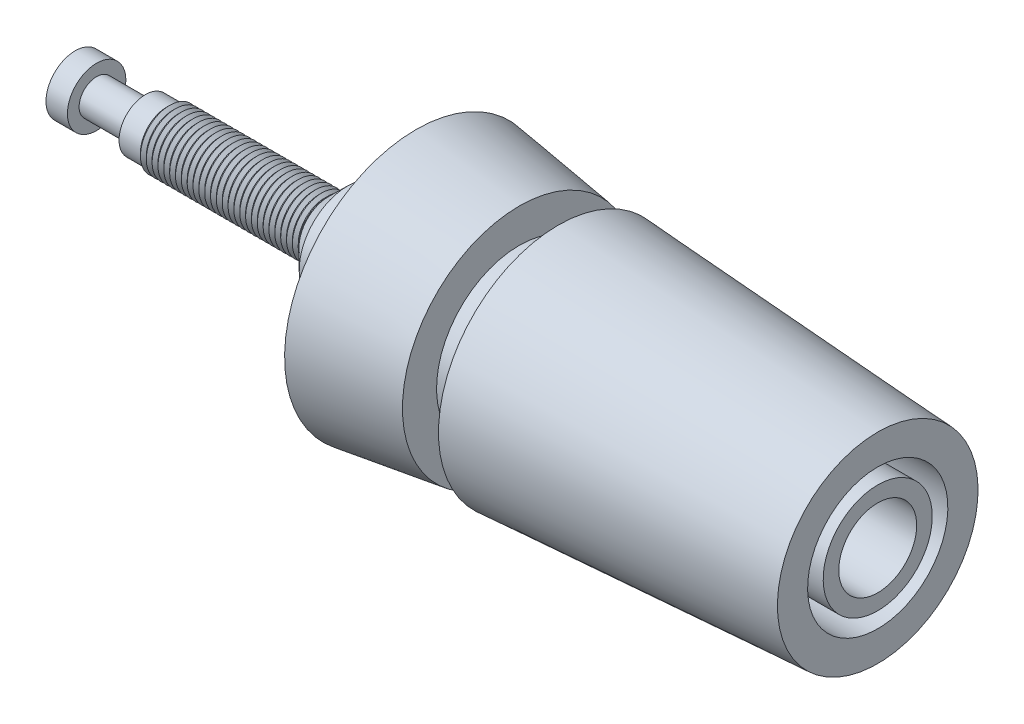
ISO-10303-21;
HEADER;
FILE_DESCRIPTION(('STEP AP214'),'2;1');
FILE_NAME('part.step','',(''),(''),'','','');
FILE_SCHEMA(('AUTOMOTIVE_DESIGN { 1 0 10303 214 1 1 1 1 }'));
ENDSEC;
DATA;
#1=APPLICATION_CONTEXT('core data for automotive mechanical design processes');
#2=APPLICATION_PROTOCOL_DEFINITION('international standard','automotive_design',2000,#1);
#3=PRODUCT_CONTEXT('',#1,'mechanical');
#4=PRODUCT('Part','Part','',(#3));
#5=PRODUCT_RELATED_PRODUCT_CATEGORY('part','',(#4));
#6=PRODUCT_DEFINITION_FORMATION('','',#4);
#7=PRODUCT_DEFINITION_CONTEXT('part definition',#1,'design');
#8=PRODUCT_DEFINITION('design','',#6,#7);
#9=PRODUCT_DEFINITION_SHAPE('','',#8);
#10=(LENGTH_UNIT() NAMED_UNIT(*) SI_UNIT(.MILLI.,.METRE.));
#11=(NAMED_UNIT(*) PLANE_ANGLE_UNIT() SI_UNIT($,.RADIAN.));
#12=(NAMED_UNIT(*) SI_UNIT($,.STERADIAN.) SOLID_ANGLE_UNIT());
#13=UNCERTAINTY_MEASURE_WITH_UNIT(LENGTH_MEASURE(1.E-05),#10,'distance_accuracy_value','');
#14=(GEOMETRIC_REPRESENTATION_CONTEXT(3) GLOBAL_UNCERTAINTY_ASSIGNED_CONTEXT((#13)) GLOBAL_UNIT_ASSIGNED_CONTEXT((#10,
#11,#12)) REPRESENTATION_CONTEXT('',''));
#15=CARTESIAN_POINT('',(0.,0.,0.));
#16=DIRECTION('',(0.,0.,1.));
#17=DIRECTION('',(1.,0.,0.));
#18=AXIS2_PLACEMENT_3D('',#15,#16,#17);
#19=CARTESIAN_POINT('',(-41.2501274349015,0.,0.));
#20=DIRECTION('',(-1.,0.,0.));
#21=DIRECTION('',(0.,-1.,0.));
#22=AXIS2_PLACEMENT_3D('',#19,#20,#21);
#23=PLANE('',#22);
#24=CARTESIAN_POINT('',(-41.2501274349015,0.,0.));
#25=DIRECTION('',(1.,0.,0.));
#26=DIRECTION('',(0.,1.,0.));
#27=AXIS2_PLACEMENT_3D('',#24,#25,#26);
#28=CIRCLE('',#27,1.49999999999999);
#29=CARTESIAN_POINT('',(-41.2501274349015,1.5,0.));
#30=VERTEX_POINT('',#29);
#31=EDGE_CURVE('E12',#30,#30,#28,.T.);
#32=ORIENTED_EDGE('',*,*,#31,.F.);
#33=EDGE_LOOP('',(#32));
#34=FACE_BOUND('',#33,.T.);
#35=ADVANCED_FACE('F43',(#34),#23,.T.);
#36=CARTESIAN_POINT('',(-0.0501274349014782,0.,0.));
#37=DIRECTION('',(1.,0.,0.));
#38=DIRECTION('',(0.,1.,0.));
#39=AXIS2_PLACEMENT_3D('',#36,#37,#38);
#40=CYLINDRICAL_SURFACE('',#39,1.5);
#41=ORIENTED_EDGE('',*,*,#31,.T.);
#42=EDGE_LOOP('',(#41));
#43=FACE_BOUND('',#42,.T.);
#44=CARTESIAN_POINT('',(-40.1501274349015,0.,0.));
#45=DIRECTION('',(1.,0.,0.));
#46=DIRECTION('',(0.,1.,0.));
#47=AXIS2_PLACEMENT_3D('',#44,#45,#46);
#48=CIRCLE('',#47,1.5);
#49=CARTESIAN_POINT('',(-40.1501274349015,1.50000000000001,0.));
#50=VERTEX_POINT('',#49);
#51=EDGE_CURVE('E50',#50,#50,#48,.T.);
#52=ORIENTED_EDGE('',*,*,#51,.F.);
#53=EDGE_LOOP('',(#52));
#54=FACE_BOUND('',#53,.T.);
#55=ADVANCED_FACE('F280',(#43,#54),#40,.T.);
#56=CARTESIAN_POINT('',(-40.1501274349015,1.50000000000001,0.));
#57=DIRECTION('',(1.,0.,0.));
#58=DIRECTION('',(0.,1.,0.));
#59=AXIS2_PLACEMENT_3D('',#56,#57,#58);
#60=PLANE('',#59);
#61=ORIENTED_EDGE('',*,*,#51,.T.);
#62=EDGE_LOOP('',(#61));
#63=FACE_BOUND('',#62,.T.);
#64=CARTESIAN_POINT('',(-40.1501274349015,0.,0.));
#65=DIRECTION('',(1.,0.,0.));
#66=DIRECTION('',(0.,1.,0.));
#67=AXIS2_PLACEMENT_3D('',#64,#65,#66);
#68=CIRCLE('',#67,0.9);
#69=CARTESIAN_POINT('',(-40.1501274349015,0.90000000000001,0.));
#70=VERTEX_POINT('',#69);
#71=EDGE_CURVE('E272',#70,#70,#68,.T.);
#72=ORIENTED_EDGE('',*,*,#71,.F.);
#73=EDGE_LOOP('',(#72));
#74=FACE_BOUND('',#73,.T.);
#75=ADVANCED_FACE('F277',(#63,#74),#60,.T.);
#76=CARTESIAN_POINT('',(-0.0501274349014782,0.,0.));
#77=DIRECTION('',(1.,0.,0.));
#78=DIRECTION('',(0.,1.,0.));
#79=AXIS2_PLACEMENT_3D('',#76,#77,#78);
#80=CYLINDRICAL_SURFACE('',#79,0.9);
#81=ORIENTED_EDGE('',*,*,#71,.T.);
#82=EDGE_LOOP('',(#81));
#83=FACE_BOUND('',#82,.T.);
#84=CARTESIAN_POINT('',(-37.6501274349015,0.,0.));
#85=DIRECTION('',(1.,0.,0.));
#86=DIRECTION('',(0.,1.,0.));
#87=AXIS2_PLACEMENT_3D('',#84,#85,#86);
#88=CIRCLE('',#87,0.9);
#89=CARTESIAN_POINT('',(-37.6501274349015,0.900000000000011,0.));
#90=VERTEX_POINT('',#89);
#91=EDGE_CURVE('E269',#90,#90,#88,.T.);
#92=ORIENTED_EDGE('',*,*,#91,.F.);
#93=EDGE_LOOP('',(#92));
#94=FACE_BOUND('',#93,.T.);
#95=ADVANCED_FACE('F287',(#83,#94),#80,.T.);
#96=CARTESIAN_POINT('',(-37.6501274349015,0.900000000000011,0.));
#97=DIRECTION('',(-1.,0.,0.));
#98=DIRECTION('',(0.,-1.,0.));
#99=AXIS2_PLACEMENT_3D('',#96,#97,#98);
#100=PLANE('',#99);
#101=ORIENTED_EDGE('',*,*,#91,.T.);
#102=EDGE_LOOP('',(#101));
#103=FACE_BOUND('',#102,.T.);
#104=CARTESIAN_POINT('',(-37.6501274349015,0.,0.));
#105=DIRECTION('',(1.,0.,0.));
#106=DIRECTION('',(0.,1.,0.));
#107=AXIS2_PLACEMENT_3D('',#104,#105,#106);
#108=CIRCLE('',#107,1.35);
#109=CARTESIAN_POINT('',(-37.6501274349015,1.35000000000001,0.));
#110=VERTEX_POINT('',#109);
#111=EDGE_CURVE('E266',#110,#110,#108,.T.);
#112=ORIENTED_EDGE('',*,*,#111,.F.);
#113=EDGE_LOOP('',(#112));
#114=FACE_BOUND('',#113,.T.);
#115=ADVANCED_FACE('F293',(#103,#114),#100,.T.);
#116=CARTESIAN_POINT('',(-0.0501274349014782,0.,0.));
#117=DIRECTION('',(1.,0.,0.));
#118=DIRECTION('',(0.,1.,0.));
#119=AXIS2_PLACEMENT_3D('',#116,#117,#118);
#120=CYLINDRICAL_SURFACE('',#119,1.35);
#121=ORIENTED_EDGE('',*,*,#111,.T.);
#122=EDGE_LOOP('',(#121));
#123=FACE_BOUND('',#122,.T.);
#124=CARTESIAN_POINT('',(-36.5501274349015,0.,0.));
#125=DIRECTION('',(1.,0.,0.));
#126=DIRECTION('',(0.,1.,0.));
#127=AXIS2_PLACEMENT_3D('',#124,#125,#126);
#128=CIRCLE('',#127,1.35);
#129=CARTESIAN_POINT('',(-36.5501274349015,1.35000000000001,0.));
#130=VERTEX_POINT('',#129);
#131=EDGE_CURVE('E263',#130,#130,#128,.T.);
#132=ORIENTED_EDGE('',*,*,#131,.F.);
#133=EDGE_LOOP('',(#132));
#134=FACE_BOUND('',#133,.T.);
#135=ADVANCED_FACE('F297',(#123,#134),#120,.T.);
#136=CARTESIAN_POINT('',(-36.4001274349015,0.,0.));
#137=DIRECTION('',(1.,0.,0.));
#138=DIRECTION('',(0.,1.,0.));
#139=AXIS2_PLACEMENT_3D('',#136,#137,#138);
#140=CONICAL_SURFACE('',#139,1.5,0.785398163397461);
#141=ORIENTED_EDGE('',*,*,#131,.T.);
#142=EDGE_LOOP('',(#141));
#143=FACE_BOUND('',#142,.T.);
#144=CARTESIAN_POINT('',(-36.4001274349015,0.,0.));
#145=DIRECTION('',(1.,0.,0.));
#146=DIRECTION('',(0.,1.,0.));
#147=AXIS2_PLACEMENT_3D('',#144,#145,#146);
#148=CIRCLE('',#147,1.5);
#149=CARTESIAN_POINT('',(-36.4001274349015,1.50000000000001,0.));
#150=VERTEX_POINT('',#149);
#151=EDGE_CURVE('E260',#150,#150,#148,.T.);
#152=ORIENTED_EDGE('',*,*,#151,.F.);
#153=EDGE_LOOP('',(#152));
#154=FACE_BOUND('',#153,.T.);
#155=ADVANCED_FACE('F301',(#143,#154),#140,.T.);
#156=CARTESIAN_POINT('',(-36.2501274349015,0.,0.));
#157=DIRECTION('',(-1.,0.,0.));
#158=DIRECTION('',(0.,-1.,0.));
#159=AXIS2_PLACEMENT_3D('',#156,#157,#158);
#160=CONICAL_SURFACE('',#159,1.35,0.785398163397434);
#161=ORIENTED_EDGE('',*,*,#151,.T.);
#162=EDGE_LOOP('',(#161));
#163=FACE_BOUND('',#162,.T.);
#164=CARTESIAN_POINT('',(-36.2501274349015,0.,0.));
#165=DIRECTION('',(1.,0.,0.));
#166=DIRECTION('',(0.,1.,0.));
#167=AXIS2_PLACEMENT_3D('',#164,#165,#166);
#168=CIRCLE('',#167,1.35);
#169=CARTESIAN_POINT('',(-36.2501274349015,1.35000000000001,0.));
#170=VERTEX_POINT('',#169);
#171=EDGE_CURVE('E257',#170,#170,#168,.T.);
#172=ORIENTED_EDGE('',*,*,#171,.F.);
#173=EDGE_LOOP('',(#172));
#174=FACE_BOUND('',#173,.T.);
#175=ADVANCED_FACE('F305',(#163,#174),#160,.T.);
#176=CARTESIAN_POINT('',(-36.1001274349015,0.,0.));
#177=DIRECTION('',(1.,0.,0.));
#178=DIRECTION('',(0.,1.,0.));
#179=AXIS2_PLACEMENT_3D('',#176,#177,#178);
#180=CONICAL_SURFACE('',#179,1.5,0.785398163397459);
#181=ORIENTED_EDGE('',*,*,#171,.T.);
#182=EDGE_LOOP('',(#181));
#183=FACE_BOUND('',#182,.T.);
#184=CARTESIAN_POINT('',(-36.1001274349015,0.,0.));
#185=DIRECTION('',(1.,0.,0.));
#186=DIRECTION('',(0.,1.,0.));
#187=AXIS2_PLACEMENT_3D('',#184,#185,#186);
#188=CIRCLE('',#187,1.5);
#189=CARTESIAN_POINT('',(-36.1001274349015,1.50000000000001,0.));
#190=VERTEX_POINT('',#189);
#191=EDGE_CURVE('E254',#190,#190,#188,.T.);
#192=ORIENTED_EDGE('',*,*,#191,.F.);
#193=EDGE_LOOP('',(#192));
#194=FACE_BOUND('',#193,.T.);
#195=ADVANCED_FACE('F309',(#183,#194),#180,.T.);
#196=CARTESIAN_POINT('',(-35.9501274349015,0.,0.));
#197=DIRECTION('',(-1.,0.,0.));
#198=DIRECTION('',(0.,-1.,0.));
#199=AXIS2_PLACEMENT_3D('',#196,#197,#198);
#200=CONICAL_SURFACE('',#199,1.35,0.785398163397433);
#201=ORIENTED_EDGE('',*,*,#191,.T.);
#202=EDGE_LOOP('',(#201));
#203=FACE_BOUND('',#202,.T.);
#204=CARTESIAN_POINT('',(-35.9501274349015,0.,0.));
#205=DIRECTION('',(1.,0.,0.));
#206=DIRECTION('',(0.,1.,0.));
#207=AXIS2_PLACEMENT_3D('',#204,#205,#206);
#208=CIRCLE('',#207,1.35);
#209=CARTESIAN_POINT('',(-35.9501274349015,1.35000000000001,0.));
#210=VERTEX_POINT('',#209);
#211=EDGE_CURVE('E251',#210,#210,#208,.T.);
#212=ORIENTED_EDGE('',*,*,#211,.F.);
#213=EDGE_LOOP('',(#212));
#214=FACE_BOUND('',#213,.T.);
#215=ADVANCED_FACE('F313',(#203,#214),#200,.T.);
#216=CARTESIAN_POINT('',(-35.8001274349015,0.,0.));
#217=DIRECTION('',(1.,0.,0.));
#218=DIRECTION('',(0.,1.,0.));
#219=AXIS2_PLACEMENT_3D('',#216,#217,#218);
#220=CONICAL_SURFACE('',#219,1.5,0.785398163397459);
#221=ORIENTED_EDGE('',*,*,#211,.T.);
#222=EDGE_LOOP('',(#221));
#223=FACE_BOUND('',#222,.T.);
#224=CARTESIAN_POINT('',(-35.8001274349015,0.,0.));
#225=DIRECTION('',(1.,0.,0.));
#226=DIRECTION('',(0.,1.,0.));
#227=AXIS2_PLACEMENT_3D('',#224,#225,#226);
#228=CIRCLE('',#227,1.5);
#229=CARTESIAN_POINT('',(-35.8001274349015,1.50000000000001,0.));
#230=VERTEX_POINT('',#229);
#231=EDGE_CURVE('E248',#230,#230,#228,.T.);
#232=ORIENTED_EDGE('',*,*,#231,.F.);
#233=EDGE_LOOP('',(#232));
#234=FACE_BOUND('',#233,.T.);
#235=ADVANCED_FACE('F317',(#223,#234),#220,.T.);
#236=CARTESIAN_POINT('',(-35.6501274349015,0.,0.));
#237=DIRECTION('',(-1.,0.,0.));
#238=DIRECTION('',(0.,-1.,0.));
#239=AXIS2_PLACEMENT_3D('',#236,#237,#238);
#240=CONICAL_SURFACE('',#239,1.35,0.785398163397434);
#241=ORIENTED_EDGE('',*,*,#231,.T.);
#242=EDGE_LOOP('',(#241));
#243=FACE_BOUND('',#242,.T.);
#244=CARTESIAN_POINT('',(-35.6501274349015,0.,0.));
#245=DIRECTION('',(1.,0.,0.));
#246=DIRECTION('',(0.,1.,0.));
#247=AXIS2_PLACEMENT_3D('',#244,#245,#246);
#248=CIRCLE('',#247,1.35);
#249=CARTESIAN_POINT('',(-35.6501274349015,1.35000000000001,0.));
#250=VERTEX_POINT('',#249);
#251=EDGE_CURVE('E245',#250,#250,#248,.T.);
#252=ORIENTED_EDGE('',*,*,#251,.F.);
#253=EDGE_LOOP('',(#252));
#254=FACE_BOUND('',#253,.T.);
#255=ADVANCED_FACE('F321',(#243,#254),#240,.T.);
#256=CARTESIAN_POINT('',(-35.5001274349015,0.,0.));
#257=DIRECTION('',(1.,0.,0.));
#258=DIRECTION('',(0.,1.,0.));
#259=AXIS2_PLACEMENT_3D('',#256,#257,#258);
#260=CONICAL_SURFACE('',#259,1.5,0.785398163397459);
#261=ORIENTED_EDGE('',*,*,#251,.T.);
#262=EDGE_LOOP('',(#261));
#263=FACE_BOUND('',#262,.T.);
#264=CARTESIAN_POINT('',(-35.5001274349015,0.,0.));
#265=DIRECTION('',(1.,0.,0.));
#266=DIRECTION('',(0.,1.,0.));
#267=AXIS2_PLACEMENT_3D('',#264,#265,#266);
#268=CIRCLE('',#267,1.5);
#269=CARTESIAN_POINT('',(-35.5001274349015,1.50000000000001,0.));
#270=VERTEX_POINT('',#269);
#271=EDGE_CURVE('E242',#270,#270,#268,.T.);
#272=ORIENTED_EDGE('',*,*,#271,.F.);
#273=EDGE_LOOP('',(#272));
#274=FACE_BOUND('',#273,.T.);
#275=ADVANCED_FACE('F325',(#263,#274),#260,.T.);
#276=CARTESIAN_POINT('',(-35.3501274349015,0.,0.));
#277=DIRECTION('',(-1.,0.,0.));
#278=DIRECTION('',(0.,-1.,0.));
#279=AXIS2_PLACEMENT_3D('',#276,#277,#278);
#280=CONICAL_SURFACE('',#279,1.35000000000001,0.785398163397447);
#281=ORIENTED_EDGE('',*,*,#271,.T.);
#282=EDGE_LOOP('',(#281));
#283=FACE_BOUND('',#282,.T.);
#284=CARTESIAN_POINT('',(-35.3501274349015,0.,0.));
#285=DIRECTION('',(1.,0.,0.));
#286=DIRECTION('',(0.,1.,0.));
#287=AXIS2_PLACEMENT_3D('',#284,#285,#286);
#288=CIRCLE('',#287,1.35000000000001);
#289=CARTESIAN_POINT('',(-35.3501274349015,1.35000000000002,0.));
#290=VERTEX_POINT('',#289);
#291=EDGE_CURVE('E239',#290,#290,#288,.T.);
#292=ORIENTED_EDGE('',*,*,#291,.F.);
#293=EDGE_LOOP('',(#292));
#294=FACE_BOUND('',#293,.T.);
#295=ADVANCED_FACE('F329',(#283,#294),#280,.T.);
#296=CARTESIAN_POINT('',(-35.2001274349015,0.,0.));
#297=DIRECTION('',(1.,0.,0.));
#298=DIRECTION('',(0.,1.,0.));
#299=AXIS2_PLACEMENT_3D('',#296,#297,#298);
#300=CONICAL_SURFACE('',#299,1.50000000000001,0.785398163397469);
#301=ORIENTED_EDGE('',*,*,#291,.T.);
#302=EDGE_LOOP('',(#301));
#303=FACE_BOUND('',#302,.T.);
#304=CARTESIAN_POINT('',(-35.2001274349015,0.,0.));
#305=DIRECTION('',(1.,0.,0.));
#306=DIRECTION('',(0.,1.,0.));
#307=AXIS2_PLACEMENT_3D('',#304,#305,#306);
#308=CIRCLE('',#307,1.50000000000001);
#309=CARTESIAN_POINT('',(-35.2001274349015,1.50000000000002,0.));
#310=VERTEX_POINT('',#309);
#311=EDGE_CURVE('E236',#310,#310,#308,.T.);
#312=ORIENTED_EDGE('',*,*,#311,.F.);
#313=EDGE_LOOP('',(#312));
#314=FACE_BOUND('',#313,.T.);
#315=ADVANCED_FACE('F333',(#303,#314),#300,.T.);
#316=CARTESIAN_POINT('',(-35.0501274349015,0.,0.));
#317=DIRECTION('',(-1.,0.,0.));
#318=DIRECTION('',(0.,-1.,0.));
#319=AXIS2_PLACEMENT_3D('',#316,#317,#318);
#320=CONICAL_SURFACE('',#319,1.35000000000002,0.785398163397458);
#321=ORIENTED_EDGE('',*,*,#311,.T.);
#322=EDGE_LOOP('',(#321));
#323=FACE_BOUND('',#322,.T.);
#324=CARTESIAN_POINT('',(-35.0501274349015,0.,0.));
#325=DIRECTION('',(1.,0.,0.));
#326=DIRECTION('',(0.,1.,0.));
#327=AXIS2_PLACEMENT_3D('',#324,#325,#326);
#328=CIRCLE('',#327,1.35000000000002);
#329=CARTESIAN_POINT('',(-35.0501274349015,1.35000000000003,0.));
#330=VERTEX_POINT('',#329);
#331=EDGE_CURVE('E233',#330,#330,#328,.T.);
#332=ORIENTED_EDGE('',*,*,#331,.F.);
#333=EDGE_LOOP('',(#332));
#334=FACE_BOUND('',#333,.T.);
#335=ADVANCED_FACE('F337',(#323,#334),#320,.T.);
#336=CARTESIAN_POINT('',(-34.9001274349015,0.,0.));
#337=DIRECTION('',(1.,0.,0.));
#338=DIRECTION('',(0.,1.,0.));
#339=AXIS2_PLACEMENT_3D('',#336,#337,#338);
#340=CONICAL_SURFACE('',#339,1.50000000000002,0.785398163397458);
#341=ORIENTED_EDGE('',*,*,#331,.T.);
#342=EDGE_LOOP('',(#341));
#343=FACE_BOUND('',#342,.T.);
#344=CARTESIAN_POINT('',(-34.9001274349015,0.,0.));
#345=DIRECTION('',(1.,0.,0.));
#346=DIRECTION('',(0.,1.,0.));
#347=AXIS2_PLACEMENT_3D('',#344,#345,#346);
#348=CIRCLE('',#347,1.50000000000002);
#349=CARTESIAN_POINT('',(-34.9001274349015,1.50000000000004,0.));
#350=VERTEX_POINT('',#349);
#351=EDGE_CURVE('E230',#350,#350,#348,.T.);
#352=ORIENTED_EDGE('',*,*,#351,.F.);
#353=EDGE_LOOP('',(#352));
#354=FACE_BOUND('',#353,.T.);
#355=ADVANCED_FACE('F341',(#343,#354),#340,.T.);
#356=CARTESIAN_POINT('',(-34.7501274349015,0.,0.));
#357=DIRECTION('',(-1.,0.,0.));
#358=DIRECTION('',(0.,-1.,0.));
#359=AXIS2_PLACEMENT_3D('',#356,#357,#358);
#360=CONICAL_SURFACE('',#359,1.35000000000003,0.785398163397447);
#361=ORIENTED_EDGE('',*,*,#351,.T.);
#362=EDGE_LOOP('',(#361));
#363=FACE_BOUND('',#362,.T.);
#364=CARTESIAN_POINT('',(-34.7501274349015,0.,0.));
#365=DIRECTION('',(1.,0.,0.));
#366=DIRECTION('',(0.,1.,0.));
#367=AXIS2_PLACEMENT_3D('',#364,#365,#366);
#368=CIRCLE('',#367,1.35000000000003);
#369=CARTESIAN_POINT('',(-34.7501274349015,1.35000000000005,0.));
#370=VERTEX_POINT('',#369);
#371=EDGE_CURVE('E227',#370,#370,#368,.T.);
#372=ORIENTED_EDGE('',*,*,#371,.F.);
#373=EDGE_LOOP('',(#372));
#374=FACE_BOUND('',#373,.T.);
#375=ADVANCED_FACE('F345',(#363,#374),#360,.T.);
#376=CARTESIAN_POINT('',(-34.6001274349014,0.,0.));
#377=DIRECTION('',(1.,0.,0.));
#378=DIRECTION('',(0.,1.,0.));
#379=AXIS2_PLACEMENT_3D('',#376,#377,#378);
#380=CONICAL_SURFACE('',#379,1.50000000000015,0.785398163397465);
#381=ORIENTED_EDGE('',*,*,#371,.T.);
#382=EDGE_LOOP('',(#381));
#383=FACE_BOUND('',#382,.T.);
#384=CARTESIAN_POINT('',(-34.6001274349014,0.,0.));
#385=DIRECTION('',(1.,0.,0.));
#386=DIRECTION('',(0.,1.,0.));
#387=AXIS2_PLACEMENT_3D('',#384,#385,#386);
#388=CIRCLE('',#387,1.50000000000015);
#389=CARTESIAN_POINT('',(-34.6001274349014,1.50000000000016,0.));
#390=VERTEX_POINT('',#389);
#391=EDGE_CURVE('E224',#390,#390,#388,.T.);
#392=ORIENTED_EDGE('',*,*,#391,.F.);
#393=EDGE_LOOP('',(#392));
#394=FACE_BOUND('',#393,.T.);
#395=ADVANCED_FACE('F349',(#383,#394),#380,.T.);
#396=CARTESIAN_POINT('',(-34.4501274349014,0.,0.));
#397=DIRECTION('',(-1.,0.,0.));
#398=DIRECTION('',(0.,-1.,0.));
#399=AXIS2_PLACEMENT_3D('',#396,#397,#398);
#400=CONICAL_SURFACE('',#399,1.35000000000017,0.785398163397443);
#401=ORIENTED_EDGE('',*,*,#391,.T.);
#402=EDGE_LOOP('',(#401));
#403=FACE_BOUND('',#402,.T.);
#404=CARTESIAN_POINT('',(-34.4501274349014,0.,0.));
#405=DIRECTION('',(1.,0.,0.));
#406=DIRECTION('',(0.,1.,0.));
#407=AXIS2_PLACEMENT_3D('',#404,#405,#406);
#408=CIRCLE('',#407,1.35000000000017);
#409=CARTESIAN_POINT('',(-34.4501274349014,1.35000000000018,0.));
#410=VERTEX_POINT('',#409);
#411=EDGE_CURVE('E221',#410,#410,#408,.T.);
#412=ORIENTED_EDGE('',*,*,#411,.F.);
#413=EDGE_LOOP('',(#412));
#414=FACE_BOUND('',#413,.T.);
#415=ADVANCED_FACE('F353',(#403,#414),#400,.T.);
#416=CARTESIAN_POINT('',(-34.3001274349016,0.,0.));
#417=DIRECTION('',(1.,0.,0.));
#418=DIRECTION('',(0.,1.,0.));
#419=AXIS2_PLACEMENT_3D('',#416,#417,#418);
#420=CONICAL_SURFACE('',#419,1.49999999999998,0.785398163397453);
#421=ORIENTED_EDGE('',*,*,#411,.T.);
#422=EDGE_LOOP('',(#421));
#423=FACE_BOUND('',#422,.T.);
#424=CARTESIAN_POINT('',(-34.3001274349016,0.,0.));
#425=DIRECTION('',(1.,0.,0.));
#426=DIRECTION('',(0.,1.,0.));
#427=AXIS2_PLACEMENT_3D('',#424,#425,#426);
#428=CIRCLE('',#427,1.49999999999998);
#429=CARTESIAN_POINT('',(-34.3001274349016,1.49999999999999,0.));
#430=VERTEX_POINT('',#429);
#431=EDGE_CURVE('E218',#430,#430,#428,.T.);
#432=ORIENTED_EDGE('',*,*,#431,.F.);
#433=EDGE_LOOP('',(#432));
#434=FACE_BOUND('',#433,.T.);
#435=ADVANCED_FACE('F357',(#423,#434),#420,.T.);
#436=CARTESIAN_POINT('',(-34.1501274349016,0.,0.));
#437=DIRECTION('',(-1.,0.,0.));
#438=DIRECTION('',(0.,-1.,0.));
#439=AXIS2_PLACEMENT_3D('',#436,#437,#438);
#440=CONICAL_SURFACE('',#439,1.35000000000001,0.78539816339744);
#441=ORIENTED_EDGE('',*,*,#431,.T.);
#442=EDGE_LOOP('',(#441));
#443=FACE_BOUND('',#442,.T.);
#444=CARTESIAN_POINT('',(-34.1501274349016,0.,0.));
#445=DIRECTION('',(1.,0.,0.));
#446=DIRECTION('',(0.,1.,0.));
#447=AXIS2_PLACEMENT_3D('',#444,#445,#446);
#448=CIRCLE('',#447,1.35000000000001);
#449=CARTESIAN_POINT('',(-34.1501274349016,1.35000000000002,0.));
#450=VERTEX_POINT('',#449);
#451=EDGE_CURVE('E215',#450,#450,#448,.T.);
#452=ORIENTED_EDGE('',*,*,#451,.F.);
#453=EDGE_LOOP('',(#452));
#454=FACE_BOUND('',#453,.T.);
#455=ADVANCED_FACE('F361',(#443,#454),#440,.T.);
#456=CARTESIAN_POINT('',(-34.0001274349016,0.,0.));
#457=DIRECTION('',(1.,0.,0.));
#458=DIRECTION('',(0.,1.,0.));
#459=AXIS2_PLACEMENT_3D('',#456,#457,#458);
#460=CONICAL_SURFACE('',#459,1.50000000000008,0.785398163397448);
#461=ORIENTED_EDGE('',*,*,#451,.T.);
#462=EDGE_LOOP('',(#461));
#463=FACE_BOUND('',#462,.T.);
#464=CARTESIAN_POINT('',(-34.0001274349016,0.,0.));
#465=DIRECTION('',(1.,0.,0.));
#466=DIRECTION('',(0.,1.,0.));
#467=AXIS2_PLACEMENT_3D('',#464,#465,#466);
#468=CIRCLE('',#467,1.50000000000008);
#469=CARTESIAN_POINT('',(-34.0001274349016,1.50000000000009,0.));
#470=VERTEX_POINT('',#469);
#471=EDGE_CURVE('E212',#470,#470,#468,.T.);
#472=ORIENTED_EDGE('',*,*,#471,.F.);
#473=EDGE_LOOP('',(#472));
#474=FACE_BOUND('',#473,.T.);
#475=ADVANCED_FACE('F365',(#463,#474),#460,.T.);
#476=CARTESIAN_POINT('',(-33.8501274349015,0.,0.));
#477=DIRECTION('',(-1.,0.,0.));
#478=DIRECTION('',(0.,-1.,0.));
#479=AXIS2_PLACEMENT_3D('',#476,#477,#478);
#480=CONICAL_SURFACE('',#479,1.35000000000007,0.785398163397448);
#481=ORIENTED_EDGE('',*,*,#471,.T.);
#482=EDGE_LOOP('',(#481));
#483=FACE_BOUND('',#482,.T.);
#484=CARTESIAN_POINT('',(-33.8501274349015,0.,0.));
#485=DIRECTION('',(1.,0.,0.));
#486=DIRECTION('',(0.,1.,0.));
#487=AXIS2_PLACEMENT_3D('',#484,#485,#486);
#488=CIRCLE('',#487,1.35000000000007);
#489=CARTESIAN_POINT('',(-33.8501274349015,1.35000000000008,0.));
#490=VERTEX_POINT('',#489);
#491=EDGE_CURVE('E209',#490,#490,#488,.T.);
#492=ORIENTED_EDGE('',*,*,#491,.F.);
#493=EDGE_LOOP('',(#492));
#494=FACE_BOUND('',#493,.T.);
#495=ADVANCED_FACE('F369',(#483,#494),#480,.T.);
#496=CARTESIAN_POINT('',(-33.7001274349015,0.,0.));
#497=DIRECTION('',(1.,0.,0.));
#498=DIRECTION('',(0.,1.,0.));
#499=AXIS2_PLACEMENT_3D('',#496,#497,#498);
#500=CONICAL_SURFACE('',#499,1.50000000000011,0.785398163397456);
#501=ORIENTED_EDGE('',*,*,#491,.T.);
#502=EDGE_LOOP('',(#501));
#503=FACE_BOUND('',#502,.T.);
#504=CARTESIAN_POINT('',(-33.7001274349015,0.,0.));
#505=DIRECTION('',(1.,0.,0.));
#506=DIRECTION('',(0.,1.,0.));
#507=AXIS2_PLACEMENT_3D('',#504,#505,#506);
#508=CIRCLE('',#507,1.50000000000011);
#509=CARTESIAN_POINT('',(-33.7001274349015,1.50000000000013,0.));
#510=VERTEX_POINT('',#509);
#511=EDGE_CURVE('E206',#510,#510,#508,.T.);
#512=ORIENTED_EDGE('',*,*,#511,.F.);
#513=EDGE_LOOP('',(#512));
#514=FACE_BOUND('',#513,.T.);
#515=ADVANCED_FACE('F373',(#503,#514),#500,.T.);
#516=CARTESIAN_POINT('',(-33.5501274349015,0.,0.));
#517=DIRECTION('',(-1.,0.,0.));
#518=DIRECTION('',(0.,-1.,0.));
#519=AXIS2_PLACEMENT_3D('',#516,#517,#518);
#520=CONICAL_SURFACE('',#519,1.35000000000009,0.785398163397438);
#521=ORIENTED_EDGE('',*,*,#511,.T.);
#522=EDGE_LOOP('',(#521));
#523=FACE_BOUND('',#522,.T.);
#524=CARTESIAN_POINT('',(-33.5501274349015,0.,0.));
#525=DIRECTION('',(1.,0.,0.));
#526=DIRECTION('',(0.,1.,0.));
#527=AXIS2_PLACEMENT_3D('',#524,#525,#526);
#528=CIRCLE('',#527,1.35000000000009);
#529=CARTESIAN_POINT('',(-33.5501274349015,1.3500000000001,0.));
#530=VERTEX_POINT('',#529);
#531=EDGE_CURVE('E203',#530,#530,#528,.T.);
#532=ORIENTED_EDGE('',*,*,#531,.F.);
#533=EDGE_LOOP('',(#532));
#534=FACE_BOUND('',#533,.T.);
#535=ADVANCED_FACE('F377',(#523,#534),#520,.T.);
#536=CARTESIAN_POINT('',(-33.4001274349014,0.,0.));
#537=DIRECTION('',(1.,0.,0.));
#538=DIRECTION('',(0.,1.,0.));
#539=AXIS2_PLACEMENT_3D('',#536,#537,#538);
#540=CONICAL_SURFACE('',#539,1.50000000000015,0.785398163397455);
#541=ORIENTED_EDGE('',*,*,#531,.T.);
#542=EDGE_LOOP('',(#541));
#543=FACE_BOUND('',#542,.T.);
#544=CARTESIAN_POINT('',(-33.4001274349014,0.,0.));
#545=DIRECTION('',(1.,0.,0.));
#546=DIRECTION('',(0.,1.,0.));
#547=AXIS2_PLACEMENT_3D('',#544,#545,#546);
#548=CIRCLE('',#547,1.50000000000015);
#549=CARTESIAN_POINT('',(-33.4001274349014,1.50000000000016,0.));
#550=VERTEX_POINT('',#549);
#551=EDGE_CURVE('E200',#550,#550,#548,.T.);
#552=ORIENTED_EDGE('',*,*,#551,.F.);
#553=EDGE_LOOP('',(#552));
#554=FACE_BOUND('',#553,.T.);
#555=ADVANCED_FACE('F381',(#543,#554),#540,.T.);
#556=CARTESIAN_POINT('',(-33.2501274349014,0.,0.));
#557=DIRECTION('',(-1.,0.,0.));
#558=DIRECTION('',(0.,-1.,0.));
#559=AXIS2_PLACEMENT_3D('',#556,#557,#558);
#560=CONICAL_SURFACE('',#559,1.35000000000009,0.785398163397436);
#561=ORIENTED_EDGE('',*,*,#551,.T.);
#562=EDGE_LOOP('',(#561));
#563=FACE_BOUND('',#562,.T.);
#564=CARTESIAN_POINT('',(-33.2501274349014,0.,0.));
#565=DIRECTION('',(1.,0.,0.));
#566=DIRECTION('',(0.,1.,0.));
#567=AXIS2_PLACEMENT_3D('',#564,#565,#566);
#568=CIRCLE('',#567,1.35000000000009);
#569=CARTESIAN_POINT('',(-33.2501274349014,1.3500000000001,0.));
#570=VERTEX_POINT('',#569);
#571=EDGE_CURVE('E197',#570,#570,#568,.T.);
#572=ORIENTED_EDGE('',*,*,#571,.F.);
#573=EDGE_LOOP('',(#572));
#574=FACE_BOUND('',#573,.T.);
#575=ADVANCED_FACE('F385',(#563,#574),#560,.T.);
#576=CARTESIAN_POINT('',(-33.1001274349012,0.,0.));
#577=DIRECTION('',(1.,0.,0.));
#578=DIRECTION('',(0.,1.,0.));
#579=AXIS2_PLACEMENT_3D('',#576,#577,#578);
#580=CONICAL_SURFACE('',#579,1.50000000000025,0.785398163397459);
#581=ORIENTED_EDGE('',*,*,#571,.T.);
#582=EDGE_LOOP('',(#581));
#583=FACE_BOUND('',#582,.T.);
#584=CARTESIAN_POINT('',(-33.1001274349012,0.,0.));
#585=DIRECTION('',(1.,0.,0.));
#586=DIRECTION('',(0.,1.,0.));
#587=AXIS2_PLACEMENT_3D('',#584,#585,#586);
#588=CIRCLE('',#587,1.50000000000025);
#589=CARTESIAN_POINT('',(-33.1001274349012,1.50000000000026,0.));
#590=VERTEX_POINT('',#589);
#591=EDGE_CURVE('E194',#590,#590,#588,.T.);
#592=ORIENTED_EDGE('',*,*,#591,.F.);
#593=EDGE_LOOP('',(#592));
#594=FACE_BOUND('',#593,.T.);
#595=ADVANCED_FACE('F389',(#583,#594),#580,.T.);
#596=CARTESIAN_POINT('',(-32.9501274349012,0.,0.));
#597=DIRECTION('',(-1.,0.,0.));
#598=DIRECTION('',(0.,-1.,0.));
#599=AXIS2_PLACEMENT_3D('',#596,#597,#598);
#600=CONICAL_SURFACE('',#599,1.35000000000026,0.785398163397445);
#601=ORIENTED_EDGE('',*,*,#591,.T.);
#602=EDGE_LOOP('',(#601));
#603=FACE_BOUND('',#602,.T.);
#604=CARTESIAN_POINT('',(-32.9501274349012,0.,0.));
#605=DIRECTION('',(1.,0.,0.));
#606=DIRECTION('',(0.,1.,0.));
#607=AXIS2_PLACEMENT_3D('',#604,#605,#606);
#608=CIRCLE('',#607,1.35000000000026);
#609=CARTESIAN_POINT('',(-32.9501274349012,1.35000000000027,0.));
#610=VERTEX_POINT('',#609);
#611=EDGE_CURVE('E191',#610,#610,#608,.T.);
#612=ORIENTED_EDGE('',*,*,#611,.F.);
#613=EDGE_LOOP('',(#612));
#614=FACE_BOUND('',#613,.T.);
#615=ADVANCED_FACE('F393',(#603,#614),#600,.T.);
#616=CARTESIAN_POINT('',(-32.8001274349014,0.,0.));
#617=DIRECTION('',(1.,0.,0.));
#618=DIRECTION('',(0.,1.,0.));
#619=AXIS2_PLACEMENT_3D('',#616,#617,#618);
#620=CONICAL_SURFACE('',#619,1.50000000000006,0.785398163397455);
#621=ORIENTED_EDGE('',*,*,#611,.T.);
#622=EDGE_LOOP('',(#621));
#623=FACE_BOUND('',#622,.T.);
#624=CARTESIAN_POINT('',(-32.8001274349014,0.,0.));
#625=DIRECTION('',(1.,0.,0.));
#626=DIRECTION('',(0.,1.,0.));
#627=AXIS2_PLACEMENT_3D('',#624,#625,#626);
#628=CIRCLE('',#627,1.50000000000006);
#629=CARTESIAN_POINT('',(-32.8001274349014,1.50000000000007,0.));
#630=VERTEX_POINT('',#629);
#631=EDGE_CURVE('E188',#630,#630,#628,.T.);
#632=ORIENTED_EDGE('',*,*,#631,.F.);
#633=EDGE_LOOP('',(#632));
#634=FACE_BOUND('',#633,.T.);
#635=ADVANCED_FACE('F397',(#623,#634),#620,.T.);
#636=CARTESIAN_POINT('',(-32.6501274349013,0.,0.));
#637=DIRECTION('',(-1.,0.,0.));
#638=DIRECTION('',(0.,-1.,0.));
#639=AXIS2_PLACEMENT_3D('',#636,#637,#638);
#640=CONICAL_SURFACE('',#639,1.34999999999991,0.785398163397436);
#641=ORIENTED_EDGE('',*,*,#631,.T.);
#642=EDGE_LOOP('',(#641));
#643=FACE_BOUND('',#642,.T.);
#644=CARTESIAN_POINT('',(-32.6501274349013,0.,0.));
#645=DIRECTION('',(1.,0.,0.));
#646=DIRECTION('',(0.,1.,0.));
#647=AXIS2_PLACEMENT_3D('',#644,#645,#646);
#648=CIRCLE('',#647,1.34999999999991);
#649=CARTESIAN_POINT('',(-32.6501274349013,1.34999999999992,0.));
#650=VERTEX_POINT('',#649);
#651=EDGE_CURVE('E185',#650,#650,#648,.T.);
#652=ORIENTED_EDGE('',*,*,#651,.F.);
#653=EDGE_LOOP('',(#652));
#654=FACE_BOUND('',#653,.T.);
#655=ADVANCED_FACE('F401',(#643,#654),#640,.T.);
#656=CARTESIAN_POINT('',(-32.5001274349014,0.,0.));
#657=DIRECTION('',(1.,0.,0.));
#658=DIRECTION('',(0.,1.,0.));
#659=AXIS2_PLACEMENT_3D('',#656,#657,#658);
#660=CONICAL_SURFACE('',#659,1.49999999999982,0.785398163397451);
#661=ORIENTED_EDGE('',*,*,#651,.T.);
#662=EDGE_LOOP('',(#661));
#663=FACE_BOUND('',#662,.T.);
#664=CARTESIAN_POINT('',(-32.5001274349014,0.,0.));
#665=DIRECTION('',(1.,0.,0.));
#666=DIRECTION('',(0.,1.,0.));
#667=AXIS2_PLACEMENT_3D('',#664,#665,#666);
#668=CIRCLE('',#667,1.49999999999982);
#669=CARTESIAN_POINT('',(-32.5001274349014,1.49999999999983,0.));
#670=VERTEX_POINT('',#669);
#671=EDGE_CURVE('E182',#670,#670,#668,.T.);
#672=ORIENTED_EDGE('',*,*,#671,.F.);
#673=EDGE_LOOP('',(#672));
#674=FACE_BOUND('',#673,.T.);
#675=ADVANCED_FACE('F405',(#663,#674),#660,.T.);
#676=CARTESIAN_POINT('',(-32.3501274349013,0.,0.));
#677=DIRECTION('',(-1.,0.,0.));
#678=DIRECTION('',(0.,-1.,0.));
#679=AXIS2_PLACEMENT_3D('',#676,#677,#678);
#680=CONICAL_SURFACE('',#679,1.34999999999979,0.785398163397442);
#681=ORIENTED_EDGE('',*,*,#671,.T.);
#682=EDGE_LOOP('',(#681));
#683=FACE_BOUND('',#682,.T.);
#684=CARTESIAN_POINT('',(-32.3501274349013,0.,0.));
#685=DIRECTION('',(1.,0.,0.));
#686=DIRECTION('',(0.,1.,0.));
#687=AXIS2_PLACEMENT_3D('',#684,#685,#686);
#688=CIRCLE('',#687,1.34999999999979);
#689=CARTESIAN_POINT('',(-32.3501274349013,1.3499999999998,0.));
#690=VERTEX_POINT('',#689);
#691=EDGE_CURVE('E179',#690,#690,#688,.T.);
#692=ORIENTED_EDGE('',*,*,#691,.F.);
#693=EDGE_LOOP('',(#692));
#694=FACE_BOUND('',#693,.T.);
#695=ADVANCED_FACE('F409',(#683,#694),#680,.T.);
#696=CARTESIAN_POINT('',(-32.2001274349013,0.,0.));
#697=DIRECTION('',(1.,0.,0.));
#698=DIRECTION('',(0.,1.,0.));
#699=AXIS2_PLACEMENT_3D('',#696,#697,#698);
#700=CONICAL_SURFACE('',#699,1.49999999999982,0.785398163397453);
#701=ORIENTED_EDGE('',*,*,#691,.T.);
#702=EDGE_LOOP('',(#701));
#703=FACE_BOUND('',#702,.T.);
#704=CARTESIAN_POINT('',(-32.2001274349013,0.,0.));
#705=DIRECTION('',(1.,0.,0.));
#706=DIRECTION('',(0.,1.,0.));
#707=AXIS2_PLACEMENT_3D('',#704,#705,#706);
#708=CIRCLE('',#707,1.49999999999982);
#709=CARTESIAN_POINT('',(-32.2001274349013,1.49999999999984,0.));
#710=VERTEX_POINT('',#709);
#711=EDGE_CURVE('E176',#710,#710,#708,.T.);
#712=ORIENTED_EDGE('',*,*,#711,.F.);
#713=EDGE_LOOP('',(#712));
#714=FACE_BOUND('',#713,.T.);
#715=ADVANCED_FACE('F413',(#703,#714),#700,.T.);
#716=CARTESIAN_POINT('',(-32.0501274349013,0.,0.));
#717=DIRECTION('',(-1.,0.,0.));
#718=DIRECTION('',(0.,-1.,0.));
#719=AXIS2_PLACEMENT_3D('',#716,#717,#718);
#720=CONICAL_SURFACE('',#719,1.3499999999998,0.785398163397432);
#721=ORIENTED_EDGE('',*,*,#711,.T.);
#722=EDGE_LOOP('',(#721));
#723=FACE_BOUND('',#722,.T.);
#724=CARTESIAN_POINT('',(-32.0501274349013,0.,0.));
#725=DIRECTION('',(1.,0.,0.));
#726=DIRECTION('',(0.,1.,0.));
#727=AXIS2_PLACEMENT_3D('',#724,#725,#726);
#728=CIRCLE('',#727,1.3499999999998);
#729=CARTESIAN_POINT('',(-32.0501274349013,1.34999999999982,0.));
#730=VERTEX_POINT('',#729);
#731=EDGE_CURVE('E173',#730,#730,#728,.T.);
#732=ORIENTED_EDGE('',*,*,#731,.F.);
#733=EDGE_LOOP('',(#732));
#734=FACE_BOUND('',#733,.T.);
#735=ADVANCED_FACE('F417',(#723,#734),#720,.T.);
#736=CARTESIAN_POINT('',(-31.9001274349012,0.,0.));
#737=DIRECTION('',(1.,0.,0.));
#738=DIRECTION('',(0.,1.,0.));
#739=AXIS2_PLACEMENT_3D('',#736,#737,#738);
#740=CONICAL_SURFACE('',#739,1.49999999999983,0.785398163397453);
#741=ORIENTED_EDGE('',*,*,#731,.T.);
#742=EDGE_LOOP('',(#741));
#743=FACE_BOUND('',#742,.T.);
#744=CARTESIAN_POINT('',(-31.9001274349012,0.,0.));
#745=DIRECTION('',(1.,0.,0.));
#746=DIRECTION('',(0.,1.,0.));
#747=AXIS2_PLACEMENT_3D('',#744,#745,#746);
#748=CIRCLE('',#747,1.49999999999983);
#749=CARTESIAN_POINT('',(-31.9001274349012,1.49999999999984,0.));
#750=VERTEX_POINT('',#749);
#751=EDGE_CURVE('E170',#750,#750,#748,.T.);
#752=ORIENTED_EDGE('',*,*,#751,.F.);
#753=EDGE_LOOP('',(#752));
#754=FACE_BOUND('',#753,.T.);
#755=ADVANCED_FACE('F421',(#743,#754),#740,.T.);
#756=CARTESIAN_POINT('',(-31.7501274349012,0.,0.));
#757=DIRECTION('',(-1.,0.,0.));
#758=DIRECTION('',(0.,-1.,0.));
#759=AXIS2_PLACEMENT_3D('',#756,#757,#758);
#760=CONICAL_SURFACE('',#759,1.3499999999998,0.785398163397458);
#761=ORIENTED_EDGE('',*,*,#751,.T.);
#762=EDGE_LOOP('',(#761));
#763=FACE_BOUND('',#762,.T.);
#764=CARTESIAN_POINT('',(-31.7501274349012,0.,0.));
#765=DIRECTION('',(1.,0.,0.));
#766=DIRECTION('',(0.,1.,0.));
#767=AXIS2_PLACEMENT_3D('',#764,#765,#766);
#768=CIRCLE('',#767,1.3499999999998);
#769=CARTESIAN_POINT('',(-31.7501274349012,1.34999999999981,0.));
#770=VERTEX_POINT('',#769);
#771=EDGE_CURVE('E167',#770,#770,#768,.T.);
#772=ORIENTED_EDGE('',*,*,#771,.F.);
#773=EDGE_LOOP('',(#772));
#774=FACE_BOUND('',#773,.T.);
#775=ADVANCED_FACE('F425',(#763,#774),#760,.T.);
#776=CARTESIAN_POINT('',(-31.6001274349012,0.,0.));
#777=DIRECTION('',(1.,0.,0.));
#778=DIRECTION('',(0.,1.,0.));
#779=AXIS2_PLACEMENT_3D('',#776,#777,#778);
#780=CONICAL_SURFACE('',#779,1.49999999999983,0.785398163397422);
#781=ORIENTED_EDGE('',*,*,#771,.T.);
#782=EDGE_LOOP('',(#781));
#783=FACE_BOUND('',#782,.T.);
#784=CARTESIAN_POINT('',(-31.6001274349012,0.,0.));
#785=DIRECTION('',(1.,0.,0.));
#786=DIRECTION('',(0.,1.,0.));
#787=AXIS2_PLACEMENT_3D('',#784,#785,#786);
#788=CIRCLE('',#787,1.49999999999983);
#789=CARTESIAN_POINT('',(-31.6001274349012,1.49999999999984,0.));
#790=VERTEX_POINT('',#789);
#791=EDGE_CURVE('E164',#790,#790,#788,.T.);
#792=ORIENTED_EDGE('',*,*,#791,.F.);
#793=EDGE_LOOP('',(#792));
#794=FACE_BOUND('',#793,.T.);
#795=ADVANCED_FACE('F429',(#783,#794),#780,.T.);
#796=CARTESIAN_POINT('',(-31.4501274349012,0.,0.));
#797=DIRECTION('',(-1.,0.,0.));
#798=DIRECTION('',(0.,-1.,0.));
#799=AXIS2_PLACEMENT_3D('',#796,#797,#798);
#800=CONICAL_SURFACE('',#799,1.34999999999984,0.785398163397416);
#801=ORIENTED_EDGE('',*,*,#791,.T.);
#802=EDGE_LOOP('',(#801));
#803=FACE_BOUND('',#802,.T.);
#804=CARTESIAN_POINT('',(-31.4501274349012,0.,0.));
#805=DIRECTION('',(1.,0.,0.));
#806=DIRECTION('',(0.,1.,0.));
#807=AXIS2_PLACEMENT_3D('',#804,#805,#806);
#808=CIRCLE('',#807,1.34999999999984);
#809=CARTESIAN_POINT('',(-31.4501274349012,1.34999999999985,0.));
#810=VERTEX_POINT('',#809);
#811=EDGE_CURVE('E161',#810,#810,#808,.T.);
#812=ORIENTED_EDGE('',*,*,#811,.F.);
#813=EDGE_LOOP('',(#812));
#814=FACE_BOUND('',#813,.T.);
#815=ADVANCED_FACE('F433',(#803,#814),#800,.T.);
#816=CARTESIAN_POINT('',(-31.3001274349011,0.,0.));
#817=DIRECTION('',(1.,0.,0.));
#818=DIRECTION('',(0.,1.,0.));
#819=AXIS2_PLACEMENT_3D('',#816,#817,#818);
#820=CONICAL_SURFACE('',#819,1.49999999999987,0.785398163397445);
#821=ORIENTED_EDGE('',*,*,#811,.T.);
#822=EDGE_LOOP('',(#821));
#823=FACE_BOUND('',#822,.T.);
#824=CARTESIAN_POINT('',(-31.3001274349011,0.,0.));
#825=DIRECTION('',(1.,0.,0.));
#826=DIRECTION('',(0.,1.,0.));
#827=AXIS2_PLACEMENT_3D('',#824,#825,#826);
#828=CIRCLE('',#827,1.49999999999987);
#829=CARTESIAN_POINT('',(-31.3001274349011,1.49999999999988,0.));
#830=VERTEX_POINT('',#829);
#831=EDGE_CURVE('E158',#830,#830,#828,.T.);
#832=ORIENTED_EDGE('',*,*,#831,.F.);
#833=EDGE_LOOP('',(#832));
#834=FACE_BOUND('',#833,.T.);
#835=ADVANCED_FACE('F437',(#823,#834),#820,.T.);
#836=CARTESIAN_POINT('',(-31.150127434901,0.,0.));
#837=DIRECTION('',(-1.,0.,0.));
#838=DIRECTION('',(0.,-1.,0.));
#839=AXIS2_PLACEMENT_3D('',#836,#837,#838);
#840=CONICAL_SURFACE('',#839,1.34999999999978,0.785398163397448);
#841=ORIENTED_EDGE('',*,*,#831,.T.);
#842=EDGE_LOOP('',(#841));
#843=FACE_BOUND('',#842,.T.);
#844=CARTESIAN_POINT('',(-31.150127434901,0.,0.));
#845=DIRECTION('',(1.,0.,0.));
#846=DIRECTION('',(0.,1.,0.));
#847=AXIS2_PLACEMENT_3D('',#844,#845,#846);
#848=CIRCLE('',#847,1.34999999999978);
#849=CARTESIAN_POINT('',(-31.150127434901,1.34999999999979,0.));
#850=VERTEX_POINT('',#849);
#851=EDGE_CURVE('E155',#850,#850,#848,.T.);
#852=ORIENTED_EDGE('',*,*,#851,.F.);
#853=EDGE_LOOP('',(#852));
#854=FACE_BOUND('',#853,.T.);
#855=ADVANCED_FACE('F441',(#843,#854),#840,.T.);
#856=CARTESIAN_POINT('',(-31.0001274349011,0.,0.));
#857=DIRECTION('',(1.,0.,0.));
#858=DIRECTION('',(0.,1.,0.));
#859=AXIS2_PLACEMENT_3D('',#856,#857,#858);
#860=CONICAL_SURFACE('',#859,1.49999999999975,0.785398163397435);
#861=ORIENTED_EDGE('',*,*,#851,.T.);
#862=EDGE_LOOP('',(#861));
#863=FACE_BOUND('',#862,.T.);
#864=CARTESIAN_POINT('',(-31.0001274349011,0.,0.));
#865=DIRECTION('',(1.,0.,0.));
#866=DIRECTION('',(0.,1.,0.));
#867=AXIS2_PLACEMENT_3D('',#864,#865,#866);
#868=CIRCLE('',#867,1.49999999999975);
#869=CARTESIAN_POINT('',(-31.0001274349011,1.49999999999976,0.));
#870=VERTEX_POINT('',#869);
#871=EDGE_CURVE('E152',#870,#870,#868,.T.);
#872=ORIENTED_EDGE('',*,*,#871,.F.);
#873=EDGE_LOOP('',(#872));
#874=FACE_BOUND('',#873,.T.);
#875=ADVANCED_FACE('F445',(#863,#874),#860,.T.);
#876=CARTESIAN_POINT('',(-30.8501274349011,0.,0.));
#877=DIRECTION('',(-1.,0.,0.));
#878=DIRECTION('',(0.,-1.,0.));
#879=AXIS2_PLACEMENT_3D('',#876,#877,#878);
#880=CONICAL_SURFACE('',#879,1.34999999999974,0.785398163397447);
#881=ORIENTED_EDGE('',*,*,#871,.T.);
#882=EDGE_LOOP('',(#881));
#883=FACE_BOUND('',#882,.T.);
#884=CARTESIAN_POINT('',(-30.8501274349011,0.,0.));
#885=DIRECTION('',(1.,0.,0.));
#886=DIRECTION('',(0.,1.,0.));
#887=AXIS2_PLACEMENT_3D('',#884,#885,#886);
#888=CIRCLE('',#887,1.34999999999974);
#889=CARTESIAN_POINT('',(-30.8501274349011,1.34999999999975,0.));
#890=VERTEX_POINT('',#889);
#891=EDGE_CURVE('E149',#890,#890,#888,.T.);
#892=ORIENTED_EDGE('',*,*,#891,.F.);
#893=EDGE_LOOP('',(#892));
#894=FACE_BOUND('',#893,.T.);
#895=ADVANCED_FACE('F449',(#883,#894),#880,.T.);
#896=CARTESIAN_POINT('',(-30.700127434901,0.,0.));
#897=DIRECTION('',(1.,0.,0.));
#898=DIRECTION('',(0.,1.,0.));
#899=AXIS2_PLACEMENT_3D('',#896,#897,#898);
#900=CONICAL_SURFACE('',#899,1.49999999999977,0.785398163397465);
#901=ORIENTED_EDGE('',*,*,#891,.T.);
#902=EDGE_LOOP('',(#901));
#903=FACE_BOUND('',#902,.T.);
#904=CARTESIAN_POINT('',(-30.700127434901,0.,0.));
#905=DIRECTION('',(1.,0.,0.));
#906=DIRECTION('',(0.,1.,0.));
#907=AXIS2_PLACEMENT_3D('',#904,#905,#906);
#908=CIRCLE('',#907,1.49999999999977);
#909=CARTESIAN_POINT('',(-30.700127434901,1.49999999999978,0.));
#910=VERTEX_POINT('',#909);
#911=EDGE_CURVE('E146',#910,#910,#908,.T.);
#912=ORIENTED_EDGE('',*,*,#911,.F.);
#913=EDGE_LOOP('',(#912));
#914=FACE_BOUND('',#913,.T.);
#915=ADVANCED_FACE('F453',(#903,#914),#900,.T.);
#916=CARTESIAN_POINT('',(-30.550127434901,0.,0.));
#917=DIRECTION('',(-1.,0.,0.));
#918=DIRECTION('',(0.,-1.,0.));
#919=AXIS2_PLACEMENT_3D('',#916,#917,#918);
#920=CONICAL_SURFACE('',#919,1.34999999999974,0.785398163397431);
#921=ORIENTED_EDGE('',*,*,#911,.T.);
#922=EDGE_LOOP('',(#921));
#923=FACE_BOUND('',#922,.T.);
#924=CARTESIAN_POINT('',(-30.550127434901,0.,0.));
#925=DIRECTION('',(1.,0.,0.));
#926=DIRECTION('',(0.,1.,0.));
#927=AXIS2_PLACEMENT_3D('',#924,#925,#926);
#928=CIRCLE('',#927,1.34999999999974);
#929=CARTESIAN_POINT('',(-30.550127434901,1.34999999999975,0.));
#930=VERTEX_POINT('',#929);
#931=EDGE_CURVE('E143',#930,#930,#928,.T.);
#932=ORIENTED_EDGE('',*,*,#931,.F.);
#933=EDGE_LOOP('',(#932));
#934=FACE_BOUND('',#933,.T.);
#935=ADVANCED_FACE('F457',(#923,#934),#920,.T.);
#936=CARTESIAN_POINT('',(-30.400127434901,0.,0.));
#937=DIRECTION('',(1.,0.,0.));
#938=DIRECTION('',(0.,1.,0.));
#939=AXIS2_PLACEMENT_3D('',#936,#937,#938);
#940=CONICAL_SURFACE('',#939,1.49999999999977,0.785398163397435);
#941=ORIENTED_EDGE('',*,*,#931,.T.);
#942=EDGE_LOOP('',(#941));
#943=FACE_BOUND('',#942,.T.);
#944=CARTESIAN_POINT('',(-30.400127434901,0.,0.));
#945=DIRECTION('',(1.,0.,0.));
#946=DIRECTION('',(0.,1.,0.));
#947=AXIS2_PLACEMENT_3D('',#944,#945,#946);
#948=CIRCLE('',#947,1.49999999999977);
#949=CARTESIAN_POINT('',(-30.400127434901,1.49999999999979,0.));
#950=VERTEX_POINT('',#949);
#951=EDGE_CURVE('E140',#950,#950,#948,.T.);
#952=ORIENTED_EDGE('',*,*,#951,.F.);
#953=EDGE_LOOP('',(#952));
#954=FACE_BOUND('',#953,.T.);
#955=ADVANCED_FACE('F461',(#943,#954),#940,.T.);
#956=CARTESIAN_POINT('',(-30.2501274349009,0.,0.));
#957=DIRECTION('',(-1.,0.,0.));
#958=DIRECTION('',(0.,-1.,0.));
#959=AXIS2_PLACEMENT_3D('',#956,#957,#958);
#960=CONICAL_SURFACE('',#959,1.34999999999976,0.785398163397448);
#961=ORIENTED_EDGE('',*,*,#951,.T.);
#962=EDGE_LOOP('',(#961));
#963=FACE_BOUND('',#962,.T.);
#964=CARTESIAN_POINT('',(-30.2501274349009,0.,0.));
#965=DIRECTION('',(1.,0.,0.));
#966=DIRECTION('',(0.,1.,0.));
#967=AXIS2_PLACEMENT_3D('',#964,#965,#966);
#968=CIRCLE('',#967,1.34999999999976);
#969=CARTESIAN_POINT('',(-30.2501274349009,1.34999999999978,0.));
#970=VERTEX_POINT('',#969);
#971=EDGE_CURVE('E137',#970,#970,#968,.T.);
#972=ORIENTED_EDGE('',*,*,#971,.F.);
#973=EDGE_LOOP('',(#972));
#974=FACE_BOUND('',#973,.T.);
#975=ADVANCED_FACE('F465',(#963,#974),#960,.T.);
#976=CARTESIAN_POINT('',(-30.1001274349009,0.,0.));
#977=DIRECTION('',(1.,0.,0.));
#978=DIRECTION('',(0.,1.,0.));
#979=AXIS2_PLACEMENT_3D('',#976,#977,#978);
#980=CONICAL_SURFACE('',#979,1.49999999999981,0.785398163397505);
#981=ORIENTED_EDGE('',*,*,#971,.T.);
#982=EDGE_LOOP('',(#981));
#983=FACE_BOUND('',#982,.T.);
#984=CARTESIAN_POINT('',(-30.1001274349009,0.,0.));
#985=DIRECTION('',(1.,0.,0.));
#986=DIRECTION('',(0.,1.,0.));
#987=AXIS2_PLACEMENT_3D('',#984,#985,#986);
#988=CIRCLE('',#987,1.49999999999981);
#989=CARTESIAN_POINT('',(-30.1001274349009,1.49999999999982,0.));
#990=VERTEX_POINT('',#989);
#991=EDGE_CURVE('E134',#990,#990,#988,.T.);
#992=ORIENTED_EDGE('',*,*,#991,.F.);
#993=EDGE_LOOP('',(#992));
#994=FACE_BOUND('',#993,.T.);
#995=ADVANCED_FACE('F469',(#983,#994),#980,.T.);
#996=CARTESIAN_POINT('',(-29.9501274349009,0.,0.));
#997=DIRECTION('',(-1.,0.,0.));
#998=DIRECTION('',(0.,-1.,0.));
#999=AXIS2_PLACEMENT_3D('',#996,#997,#998);
#1000=CONICAL_SURFACE('',#999,1.34999999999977,0.785398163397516);
#1001=ORIENTED_EDGE('',*,*,#991,.T.);
#1002=EDGE_LOOP('',(#1001));
#1003=FACE_BOUND('',#1002,.T.);
#1004=CARTESIAN_POINT('',(-29.9501274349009,0.,0.));
#1005=DIRECTION('',(1.,0.,0.));
#1006=DIRECTION('',(0.,1.,0.));
#1007=AXIS2_PLACEMENT_3D('',#1004,#1005,#1006);
#1008=CIRCLE('',#1007,1.34999999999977);
#1009=CARTESIAN_POINT('',(-29.9501274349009,1.34999999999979,0.));
#1010=VERTEX_POINT('',#1009);
#1011=EDGE_CURVE('E131',#1010,#1010,#1008,.T.);
#1012=ORIENTED_EDGE('',*,*,#1011,.F.);
#1013=EDGE_LOOP('',(#1012));
#1014=FACE_BOUND('',#1013,.T.);
#1015=ADVANCED_FACE('F473',(#1003,#1014),#1000,.T.);
#1016=CARTESIAN_POINT('',(-29.8001274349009,0.,0.));
#1017=DIRECTION('',(1.,0.,0.));
#1018=DIRECTION('',(0.,1.,0.));
#1019=AXIS2_PLACEMENT_3D('',#1016,#1017,#1018);
#1020=CONICAL_SURFACE('',#1019,1.49999999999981,0.785398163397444);
#1021=ORIENTED_EDGE('',*,*,#1011,.T.);
#1022=EDGE_LOOP('',(#1021));
#1023=FACE_BOUND('',#1022,.T.);
#1024=CARTESIAN_POINT('',(-29.8001274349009,0.,0.));
#1025=DIRECTION('',(1.,0.,0.));
#1026=DIRECTION('',(0.,1.,0.));
#1027=AXIS2_PLACEMENT_3D('',#1024,#1025,#1026);
#1028=CIRCLE('',#1027,1.49999999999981);
#1029=CARTESIAN_POINT('',(-29.8001274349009,1.49999999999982,0.));
#1030=VERTEX_POINT('',#1029);
#1031=EDGE_CURVE('E128',#1030,#1030,#1028,.T.);
#1032=ORIENTED_EDGE('',*,*,#1031,.F.);
#1033=EDGE_LOOP('',(#1032));
#1034=FACE_BOUND('',#1033,.T.);
#1035=ADVANCED_FACE('F477',(#1023,#1034),#1020,.T.);
#1036=CARTESIAN_POINT('',(-29.6501274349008,0.,0.));
#1037=DIRECTION('',(-1.,0.,0.));
#1038=DIRECTION('',(0.,-1.,0.));
#1039=AXIS2_PLACEMENT_3D('',#1036,#1037,#1038);
#1040=CONICAL_SURFACE('',#1039,1.34999999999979,0.785398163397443);
#1041=ORIENTED_EDGE('',*,*,#1031,.T.);
#1042=EDGE_LOOP('',(#1041));
#1043=FACE_BOUND('',#1042,.T.);
#1044=CARTESIAN_POINT('',(-29.6501274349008,0.,0.));
#1045=DIRECTION('',(1.,0.,0.));
#1046=DIRECTION('',(0.,1.,0.));
#1047=AXIS2_PLACEMENT_3D('',#1044,#1045,#1046);
#1048=CIRCLE('',#1047,1.34999999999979);
#1049=CARTESIAN_POINT('',(-29.6501274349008,1.3499999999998,0.));
#1050=VERTEX_POINT('',#1049);
#1051=EDGE_CURVE('E125',#1050,#1050,#1048,.T.);
#1052=ORIENTED_EDGE('',*,*,#1051,.F.);
#1053=EDGE_LOOP('',(#1052));
#1054=FACE_BOUND('',#1053,.T.);
#1055=ADVANCED_FACE('F481',(#1043,#1054),#1040,.T.);
#1056=CARTESIAN_POINT('',(-29.5001274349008,0.,0.));
#1057=DIRECTION('',(1.,0.,0.));
#1058=DIRECTION('',(0.,1.,0.));
#1059=AXIS2_PLACEMENT_3D('',#1056,#1057,#1058);
#1060=CONICAL_SURFACE('',#1059,1.49999999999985,0.785398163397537);
#1061=ORIENTED_EDGE('',*,*,#1051,.T.);
#1062=EDGE_LOOP('',(#1061));
#1063=FACE_BOUND('',#1062,.T.);
#1064=CARTESIAN_POINT('',(-29.5001274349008,0.,0.));
#1065=DIRECTION('',(1.,0.,0.));
#1066=DIRECTION('',(0.,1.,0.));
#1067=AXIS2_PLACEMENT_3D('',#1064,#1065,#1066);
#1068=CIRCLE('',#1067,1.49999999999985);
#1069=CARTESIAN_POINT('',(-29.5001274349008,1.49999999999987,0.));
#1070=VERTEX_POINT('',#1069);
#1071=EDGE_CURVE('E122',#1070,#1070,#1068,.T.);
#1072=ORIENTED_EDGE('',*,*,#1071,.F.);
#1073=EDGE_LOOP('',(#1072));
#1074=FACE_BOUND('',#1073,.T.);
#1075=ADVANCED_FACE('F485',(#1063,#1074),#1060,.T.);
#1076=CARTESIAN_POINT('',(-29.3501274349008,0.,0.));
#1077=DIRECTION('',(-1.,0.,0.));
#1078=DIRECTION('',(0.,-1.,0.));
#1079=AXIS2_PLACEMENT_3D('',#1076,#1077,#1078);
#1080=CONICAL_SURFACE('',#1079,1.34999999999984,0.785398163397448);
#1081=ORIENTED_EDGE('',*,*,#1071,.T.);
#1082=EDGE_LOOP('',(#1081));
#1083=FACE_BOUND('',#1082,.T.);
#1084=CARTESIAN_POINT('',(-29.3501274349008,0.,0.));
#1085=DIRECTION('',(1.,0.,0.));
#1086=DIRECTION('',(0.,1.,0.));
#1087=AXIS2_PLACEMENT_3D('',#1084,#1085,#1086);
#1088=CIRCLE('',#1087,1.34999999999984);
#1089=CARTESIAN_POINT('',(-29.3501274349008,1.34999999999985,0.));
#1090=VERTEX_POINT('',#1089);
#1091=EDGE_CURVE('E119',#1090,#1090,#1088,.T.);
#1092=ORIENTED_EDGE('',*,*,#1091,.F.);
#1093=EDGE_LOOP('',(#1092));
#1094=FACE_BOUND('',#1093,.T.);
#1095=ADVANCED_FACE('F489',(#1083,#1094),#1080,.T.);
#1096=CARTESIAN_POINT('',(-29.2001274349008,0.,0.));
#1097=DIRECTION('',(1.,0.,0.));
#1098=DIRECTION('',(0.,1.,0.));
#1099=AXIS2_PLACEMENT_3D('',#1096,#1097,#1098);
#1100=CONICAL_SURFACE('',#1099,1.49999999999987,0.785398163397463);
#1101=ORIENTED_EDGE('',*,*,#1091,.T.);
#1102=EDGE_LOOP('',(#1101));
#1103=FACE_BOUND('',#1102,.T.);
#1104=CARTESIAN_POINT('',(-29.2001274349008,0.,0.));
#1105=DIRECTION('',(1.,0.,0.));
#1106=DIRECTION('',(0.,1.,0.));
#1107=AXIS2_PLACEMENT_3D('',#1104,#1105,#1106);
#1108=CIRCLE('',#1107,1.49999999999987);
#1109=CARTESIAN_POINT('',(-29.2001274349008,1.49999999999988,0.));
#1110=VERTEX_POINT('',#1109);
#1111=EDGE_CURVE('E116',#1110,#1110,#1108,.T.);
#1112=ORIENTED_EDGE('',*,*,#1111,.F.);
#1113=EDGE_LOOP('',(#1112));
#1114=FACE_BOUND('',#1113,.T.);
#1115=ADVANCED_FACE('F493',(#1103,#1114),#1100,.T.);
#1116=CARTESIAN_POINT('',(-29.0501274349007,0.,0.));
#1117=DIRECTION('',(-1.,0.,0.));
#1118=DIRECTION('',(0.,-1.,0.));
#1119=AXIS2_PLACEMENT_3D('',#1116,#1117,#1118);
#1120=CONICAL_SURFACE('',#1119,1.34999999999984,0.785398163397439);
#1121=ORIENTED_EDGE('',*,*,#1111,.T.);
#1122=EDGE_LOOP('',(#1121));
#1123=FACE_BOUND('',#1122,.T.);
#1124=CARTESIAN_POINT('',(-29.0501274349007,0.,0.));
#1125=DIRECTION('',(1.,0.,0.));
#1126=DIRECTION('',(0.,1.,0.));
#1127=AXIS2_PLACEMENT_3D('',#1124,#1125,#1126);
#1128=CIRCLE('',#1127,1.34999999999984);
#1129=CARTESIAN_POINT('',(-29.0501274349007,1.34999999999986,0.));
#1130=VERTEX_POINT('',#1129);
#1131=EDGE_CURVE('E113',#1130,#1130,#1128,.T.);
#1132=ORIENTED_EDGE('',*,*,#1131,.F.);
#1133=EDGE_LOOP('',(#1132));
#1134=FACE_BOUND('',#1133,.T.);
#1135=ADVANCED_FACE('F497',(#1123,#1134),#1120,.T.);
#1136=CARTESIAN_POINT('',(-28.9001274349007,0.,0.));
#1137=DIRECTION('',(1.,0.,0.));
#1138=DIRECTION('',(0.,1.,0.));
#1139=AXIS2_PLACEMENT_3D('',#1136,#1137,#1138);
#1140=CONICAL_SURFACE('',#1139,1.49999999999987,0.785398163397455);
#1141=ORIENTED_EDGE('',*,*,#1131,.T.);
#1142=EDGE_LOOP('',(#1141));
#1143=FACE_BOUND('',#1142,.T.);
#1144=CARTESIAN_POINT('',(-28.9001274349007,0.,0.));
#1145=DIRECTION('',(1.,0.,0.));
#1146=DIRECTION('',(0.,1.,0.));
#1147=AXIS2_PLACEMENT_3D('',#1144,#1145,#1146);
#1148=CIRCLE('',#1147,1.49999999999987);
#1149=CARTESIAN_POINT('',(-28.9001274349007,1.49999999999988,0.));
#1150=VERTEX_POINT('',#1149);
#1151=EDGE_CURVE('E110',#1150,#1150,#1148,.T.);
#1152=ORIENTED_EDGE('',*,*,#1151,.F.);
#1153=EDGE_LOOP('',(#1152));
#1154=FACE_BOUND('',#1153,.T.);
#1155=ADVANCED_FACE('F501',(#1143,#1154),#1140,.T.);
#1156=CARTESIAN_POINT('',(-28.7501274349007,0.,0.));
#1157=DIRECTION('',(-1.,0.,0.));
#1158=DIRECTION('',(0.,-1.,0.));
#1159=AXIS2_PLACEMENT_3D('',#1156,#1157,#1158);
#1160=CONICAL_SURFACE('',#1159,1.34999999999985,0.78539816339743);
#1161=ORIENTED_EDGE('',*,*,#1151,.T.);
#1162=EDGE_LOOP('',(#1161));
#1163=FACE_BOUND('',#1162,.T.);
#1164=CARTESIAN_POINT('',(-28.7501274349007,0.,0.));
#1165=DIRECTION('',(1.,0.,0.));
#1166=DIRECTION('',(0.,1.,0.));
#1167=AXIS2_PLACEMENT_3D('',#1164,#1165,#1166);
#1168=CIRCLE('',#1167,1.34999999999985);
#1169=CARTESIAN_POINT('',(-28.7501274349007,1.34999999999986,0.));
#1170=VERTEX_POINT('',#1169);
#1171=EDGE_CURVE('E107',#1170,#1170,#1168,.T.);
#1172=ORIENTED_EDGE('',*,*,#1171,.F.);
#1173=EDGE_LOOP('',(#1172));
#1174=FACE_BOUND('',#1173,.T.);
#1175=ADVANCED_FACE('F505',(#1163,#1174),#1160,.T.);
#1176=CARTESIAN_POINT('',(-28.6001274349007,0.,0.));
#1177=DIRECTION('',(1.,0.,0.));
#1178=DIRECTION('',(0.,1.,0.));
#1179=AXIS2_PLACEMENT_3D('',#1176,#1177,#1178);
#1180=CONICAL_SURFACE('',#1179,1.49999999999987,0.78539816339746);
#1181=ORIENTED_EDGE('',*,*,#1171,.T.);
#1182=EDGE_LOOP('',(#1181));
#1183=FACE_BOUND('',#1182,.T.);
#1184=CARTESIAN_POINT('',(-28.6001274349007,0.,0.));
#1185=DIRECTION('',(1.,0.,0.));
#1186=DIRECTION('',(0.,1.,0.));
#1187=AXIS2_PLACEMENT_3D('',#1184,#1185,#1186);
#1188=CIRCLE('',#1187,1.49999999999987);
#1189=CARTESIAN_POINT('',(-28.6001274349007,1.49999999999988,0.));
#1190=VERTEX_POINT('',#1189);
#1191=EDGE_CURVE('E104',#1190,#1190,#1188,.T.);
#1192=ORIENTED_EDGE('',*,*,#1191,.F.);
#1193=EDGE_LOOP('',(#1192));
#1194=FACE_BOUND('',#1193,.T.);
#1195=ADVANCED_FACE('F509',(#1183,#1194),#1180,.T.);
#1196=CARTESIAN_POINT('',(-28.4501274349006,0.,0.));
#1197=DIRECTION('',(-1.,0.,0.));
#1198=DIRECTION('',(0.,-1.,0.));
#1199=AXIS2_PLACEMENT_3D('',#1196,#1197,#1198);
#1200=CONICAL_SURFACE('',#1199,1.34999999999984,0.785398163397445);
#1201=ORIENTED_EDGE('',*,*,#1191,.T.);
#1202=EDGE_LOOP('',(#1201));
#1203=FACE_BOUND('',#1202,.T.);
#1204=CARTESIAN_POINT('',(-28.4501274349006,0.,0.));
#1205=DIRECTION('',(1.,0.,0.));
#1206=DIRECTION('',(0.,1.,0.));
#1207=AXIS2_PLACEMENT_3D('',#1204,#1205,#1206);
#1208=CIRCLE('',#1207,1.34999999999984);
#1209=CARTESIAN_POINT('',(-28.4501274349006,1.34999999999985,0.));
#1210=VERTEX_POINT('',#1209);
#1211=EDGE_CURVE('E101',#1210,#1210,#1208,.T.);
#1212=ORIENTED_EDGE('',*,*,#1211,.F.);
#1213=EDGE_LOOP('',(#1212));
#1214=FACE_BOUND('',#1213,.T.);
#1215=ADVANCED_FACE('F513',(#1203,#1214),#1200,.T.);
#1216=CARTESIAN_POINT('',(-28.3001274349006,0.,0.));
#1217=DIRECTION('',(1.,0.,0.));
#1218=DIRECTION('',(0.,1.,0.));
#1219=AXIS2_PLACEMENT_3D('',#1216,#1217,#1218);
#1220=CONICAL_SURFACE('',#1219,1.49999999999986,0.785398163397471);
#1221=ORIENTED_EDGE('',*,*,#1211,.T.);
#1222=EDGE_LOOP('',(#1221));
#1223=FACE_BOUND('',#1222,.T.);
#1224=CARTESIAN_POINT('',(-28.3001274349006,0.,0.));
#1225=DIRECTION('',(1.,0.,0.));
#1226=DIRECTION('',(0.,1.,0.));
#1227=AXIS2_PLACEMENT_3D('',#1224,#1225,#1226);
#1228=CIRCLE('',#1227,1.49999999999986);
#1229=CARTESIAN_POINT('',(-28.3001274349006,1.49999999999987,0.));
#1230=VERTEX_POINT('',#1229);
#1231=EDGE_CURVE('E98',#1230,#1230,#1228,.T.);
#1232=ORIENTED_EDGE('',*,*,#1231,.F.);
#1233=EDGE_LOOP('',(#1232));
#1234=FACE_BOUND('',#1233,.T.);
#1235=ADVANCED_FACE('F517',(#1223,#1234),#1220,.T.);
#1236=CARTESIAN_POINT('',(-0.0501274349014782,0.,0.));
#1237=DIRECTION('',(1.,0.,0.));
#1238=DIRECTION('',(0.,1.,0.));
#1239=AXIS2_PLACEMENT_3D('',#1236,#1237,#1238);
#1240=CYLINDRICAL_SURFACE('',#1239,1.49999999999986);
#1241=ORIENTED_EDGE('',*,*,#1231,.T.);
#1242=EDGE_LOOP('',(#1241));
#1243=FACE_BOUND('',#1242,.T.);
#1244=CARTESIAN_POINT('',(-28.2618035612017,0.,0.));
#1245=DIRECTION('',(1.,0.,0.));
#1246=DIRECTION('',(0.,1.,0.));
#1247=AXIS2_PLACEMENT_3D('',#1244,#1245,#1246);
#1248=CIRCLE('',#1247,1.49999999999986);
#1249=CARTESIAN_POINT('',(-28.2618035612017,1.49999999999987,0.));
#1250=VERTEX_POINT('',#1249);
#1251=EDGE_CURVE('E95',#1250,#1250,#1248,.T.);
#1252=ORIENTED_EDGE('',*,*,#1251,.F.);
#1253=EDGE_LOOP('',(#1252));
#1254=FACE_BOUND('',#1253,.T.);
#1255=ADVANCED_FACE('F521',(#1243,#1254),#1240,.T.);
#1256=CARTESIAN_POINT('',(-27.2501274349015,0.,0.));
#1257=DIRECTION('',(1.,0.,0.));
#1258=DIRECTION('',(0.,1.,0.));
#1259=AXIS2_PLACEMENT_3D('',#1256,#1257,#1258);
#1260=CONICAL_SURFACE('',#1259,2.5,0.779594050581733);
#1261=ORIENTED_EDGE('',*,*,#1251,.T.);
#1262=EDGE_LOOP('',(#1261));
#1263=FACE_BOUND('',#1262,.T.);
#1264=CARTESIAN_POINT('',(-27.2501274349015,0.,0.));
#1265=DIRECTION('',(1.,0.,0.));
#1266=DIRECTION('',(0.,1.,0.));
#1267=AXIS2_PLACEMENT_3D('',#1264,#1265,#1266);
#1268=CIRCLE('',#1267,2.5);
#1269=CARTESIAN_POINT('',(-27.2501274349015,2.50000000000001,0.));
#1270=VERTEX_POINT('',#1269);
#1271=EDGE_CURVE('E87',#1270,#1270,#1268,.T.);
#1272=ORIENTED_EDGE('',*,*,#1271,.F.);
#1273=EDGE_LOOP('',(#1272));
#1274=FACE_BOUND('',#1273,.T.);
#1275=ADVANCED_FACE('F525',(#1263,#1274),#1260,.T.);
#1276=CARTESIAN_POINT('',(-0.0501274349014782,0.,0.));
#1277=DIRECTION('',(1.,0.,0.));
#1278=DIRECTION('',(0.,1.,0.));
#1279=AXIS2_PLACEMENT_3D('',#1276,#1277,#1278);
#1280=CYLINDRICAL_SURFACE('',#1279,2.5);
#1281=ORIENTED_EDGE('',*,*,#1271,.T.);
#1282=EDGE_LOOP('',(#1281));
#1283=FACE_BOUND('',#1282,.T.);
#1284=CARTESIAN_POINT('',(-24.2501274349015,0.,0.));
#1285=DIRECTION('',(1.,0.,0.));
#1286=DIRECTION('',(0.,1.,0.));
#1287=AXIS2_PLACEMENT_3D('',#1284,#1285,#1286);
#1288=CIRCLE('',#1287,2.5);
#1289=CARTESIAN_POINT('',(-24.2501274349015,2.50000000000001,0.));
#1290=VERTEX_POINT('',#1289);
#1291=EDGE_CURVE('E83',#1290,#1290,#1288,.T.);
#1292=ORIENTED_EDGE('',*,*,#1291,.F.);
#1293=EDGE_LOOP('',(#1292));
#1294=FACE_BOUND('',#1293,.T.);
#1295=ADVANCED_FACE('F529',(#1283,#1294),#1280,.T.);
#1296=CARTESIAN_POINT('',(-24.2501274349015,2.50000000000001,0.));
#1297=DIRECTION('',(-1.,0.,0.));
#1298=DIRECTION('',(0.,-1.,0.));
#1299=AXIS2_PLACEMENT_3D('',#1296,#1297,#1298);
#1300=PLANE('',#1299);
#1301=DIRECTION('',(0.,-1.,0.));
#1302=VECTOR('',#1301,1.);
#1303=CARTESIAN_POINT('',(-24.2501274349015,0.,3.9));
#1304=LINE('',#1303,#1302);
#1305=CARTESIAN_POINT('',(-24.2501274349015,2.24499443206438,3.9));
#1306=VERTEX_POINT('',#1305);
#1307=CARTESIAN_POINT('',(-24.2501274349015,-2.24499443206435,3.9));
#1308=VERTEX_POINT('',#1307);
#1309=EDGE_CURVE('E69',#1306,#1308,#1304,.T.);
#1310=ORIENTED_EDGE('',*,*,#1309,.F.);
#1311=CARTESIAN_POINT('',(-24.2501274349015,0.,0.));
#1312=DIRECTION('',(1.,0.,0.));
#1313=DIRECTION('',(0.,1.,0.));
#1314=AXIS2_PLACEMENT_3D('',#1311,#1312,#1313);
#1315=CIRCLE('',#1314,4.5);
#1316=EDGE_CURVE('E80',#1308,#1306,#1315,.T.);
#1317=ORIENTED_EDGE('',*,*,#1316,.F.);
#1318=EDGE_LOOP('',(#1310,#1317));
#1319=FACE_BOUND('',#1318,.T.);
#1320=ORIENTED_EDGE('',*,*,#1291,.T.);
#1321=EDGE_LOOP('',(#1320));
#1322=FACE_BOUND('',#1321,.T.);
#1323=ADVANCED_FACE('F78',(#1319,#1322),#1300,.T.);
#1324=CARTESIAN_POINT('',(-0.0501274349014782,0.,0.));
#1325=DIRECTION('',(1.,0.,0.));
#1326=DIRECTION('',(0.,1.,0.));
#1327=AXIS2_PLACEMENT_3D('',#1324,#1325,#1326);
#1328=CYLINDRICAL_SURFACE('',#1327,4.5);
#1329=DIRECTION('',(-1.,0.,0.));
#1330=VECTOR('',#1329,1.);
#1331=CARTESIAN_POINT('',(-19.220226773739,2.24499443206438,3.9));
#1332=LINE('',#1331,#1330);
#1333=CARTESIAN_POINT('',(-23.7501274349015,2.24499443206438,3.9));
#1334=VERTEX_POINT('',#1333);
#1335=EDGE_CURVE('E66',#1334,#1306,#1332,.T.);
#1336=ORIENTED_EDGE('',*,*,#1335,.F.);
#1337=CARTESIAN_POINT('',(-23.7501274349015,0.,0.));
#1338=DIRECTION('',(1.,0.,0.));
#1339=DIRECTION('',(0.,1.,0.));
#1340=AXIS2_PLACEMENT_3D('',#1337,#1338,#1339);
#1341=CIRCLE('',#1340,4.5);
#1342=CARTESIAN_POINT('',(-23.7501274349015,-2.24499443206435,3.9));
#1343=VERTEX_POINT('',#1342);
#1344=EDGE_CURVE('E84',#1343,#1334,#1341,.T.);
#1345=ORIENTED_EDGE('',*,*,#1344,.F.);
#1346=DIRECTION('',(-1.,0.,0.));
#1347=VECTOR('',#1346,1.);
#1348=CARTESIAN_POINT('',(-19.220226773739,-2.24499443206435,3.9));
#1349=LINE('',#1348,#1347);
#1350=EDGE_CURVE('E74',#1343,#1308,#1349,.T.);
#1351=ORIENTED_EDGE('',*,*,#1350,.T.);
#1352=ORIENTED_EDGE('',*,*,#1316,.T.);
#1353=EDGE_LOOP('',(#1336,#1345,#1351,#1352));
#1354=FACE_BOUND('',#1353,.T.);
#1355=ADVANCED_FACE('F82',(#1354),#1328,.T.);
#1356=CARTESIAN_POINT('',(-23.7501274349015,4.50000000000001,0.));
#1357=DIRECTION('',(-1.,0.,0.));
#1358=DIRECTION('',(0.,-1.,0.));
#1359=AXIS2_PLACEMENT_3D('',#1356,#1357,#1358);
#1360=PLANE('',#1359);
#1361=ORIENTED_EDGE('',*,*,#1344,.T.);
#1362=DIRECTION('',(0.,1.,0.));
#1363=VECTOR('',#1362,1.);
#1364=CARTESIAN_POINT('',(-23.7501274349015,0.,3.9));
#1365=LINE('',#1364,#1363);
#1366=EDGE_CURVE('E56',#1343,#1334,#1365,.T.);
#1367=ORIENTED_EDGE('',*,*,#1366,.F.);
#1368=EDGE_LOOP('',(#1361,#1367));
#1369=FACE_BOUND('',#1368,.T.);
#1370=CARTESIAN_POINT('',(-23.7501274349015,0.,0.));
#1371=DIRECTION('',(1.,0.,0.));
#1372=DIRECTION('',(0.,1.,0.));
#1373=AXIS2_PLACEMENT_3D('',#1370,#1371,#1372);
#1374=CIRCLE('',#1373,6.75);
#1375=CARTESIAN_POINT('',(-23.7501274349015,6.75000000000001,0.));
#1376=VERTEX_POINT('',#1375);
#1377=EDGE_CURVE('E89',#1376,#1376,#1374,.T.);
#1378=ORIENTED_EDGE('',*,*,#1377,.F.);
#1379=EDGE_LOOP('',(#1378));
#1380=FACE_BOUND('',#1379,.T.);
#1381=ADVANCED_FACE('F538',(#1369,#1380),#1360,.T.);
#1382=CARTESIAN_POINT('',(-18.4501274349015,0.,0.));
#1383=DIRECTION('',(-1.,0.,0.));
#1384=DIRECTION('',(0.,-1.,0.));
#1385=AXIS2_PLACEMENT_3D('',#1382,#1383,#1384);
#1386=CONICAL_SURFACE('',#1385,6.,0.140576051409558);
#1387=ORIENTED_EDGE('',*,*,#1377,.T.);
#1388=EDGE_LOOP('',(#1387));
#1389=FACE_BOUND('',#1388,.T.);
#1390=CARTESIAN_POINT('',(-18.4501274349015,0.,0.));
#1391=DIRECTION('',(1.,0.,0.));
#1392=DIRECTION('',(0.,1.,0.));
#1393=AXIS2_PLACEMENT_3D('',#1390,#1391,#1392);
#1394=CIRCLE('',#1393,6.);
#1395=CARTESIAN_POINT('',(-18.4501274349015,6.00000000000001,0.));
#1396=VERTEX_POINT('',#1395);
#1397=EDGE_CURVE('E627',#1396,#1396,#1394,.T.);
#1398=ORIENTED_EDGE('',*,*,#1397,.F.);
#1399=EDGE_LOOP('',(#1398));
#1400=FACE_BOUND('',#1399,.T.);
#1401=ADVANCED_FACE('F541',(#1389,#1400),#1386,.T.);
#1402=CARTESIAN_POINT('',(-18.4501274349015,6.00000000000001,0.));
#1403=DIRECTION('',(1.,0.,0.));
#1404=DIRECTION('',(0.,1.,0.));
#1405=AXIS2_PLACEMENT_3D('',#1402,#1403,#1404);
#1406=PLANE('',#1405);
#1407=ORIENTED_EDGE('',*,*,#1397,.T.);
#1408=EDGE_LOOP('',(#1407));
#1409=FACE_BOUND('',#1408,.T.);
#1410=CARTESIAN_POINT('',(-18.4501274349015,0.,0.));
#1411=DIRECTION('',(1.,0.,0.));
#1412=DIRECTION('',(0.,1.,0.));
#1413=AXIS2_PLACEMENT_3D('',#1410,#1411,#1412);
#1414=CIRCLE('',#1413,4.25);
#1415=CARTESIAN_POINT('',(-18.4501274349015,4.25000000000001,0.));
#1416=VERTEX_POINT('',#1415);
#1417=EDGE_CURVE('E624',#1416,#1416,#1414,.T.);
#1418=ORIENTED_EDGE('',*,*,#1417,.F.);
#1419=EDGE_LOOP('',(#1418));
#1420=FACE_BOUND('',#1419,.T.);
#1421=ADVANCED_FACE('F544',(#1409,#1420),#1406,.T.);
#1422=CARTESIAN_POINT('',(-0.0501274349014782,0.,0.));
#1423=DIRECTION('',(1.,0.,0.));
#1424=DIRECTION('',(0.,1.,0.));
#1425=AXIS2_PLACEMENT_3D('',#1422,#1423,#1424);
#1426=CYLINDRICAL_SURFACE('',#1425,4.25);
#1427=ORIENTED_EDGE('',*,*,#1417,.T.);
#1428=EDGE_LOOP('',(#1427));
#1429=FACE_BOUND('',#1428,.T.);
#1430=CARTESIAN_POINT('',(-16.4501274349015,0.,0.));
#1431=DIRECTION('',(1.,0.,0.));
#1432=DIRECTION('',(0.,1.,0.));
#1433=AXIS2_PLACEMENT_3D('',#1430,#1431,#1432);
#1434=CIRCLE('',#1433,4.25);
#1435=CARTESIAN_POINT('',(-16.4501274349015,4.25000000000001,0.));
#1436=VERTEX_POINT('',#1435);
#1437=EDGE_CURVE('E621',#1436,#1436,#1434,.T.);
#1438=ORIENTED_EDGE('',*,*,#1437,.F.);
#1439=EDGE_LOOP('',(#1438));
#1440=FACE_BOUND('',#1439,.T.);
#1441=ADVANCED_FACE('F548',(#1429,#1440),#1426,.T.);
#1442=CARTESIAN_POINT('',(-16.4501274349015,4.25000000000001,0.));
#1443=DIRECTION('',(-1.,0.,0.));
#1444=DIRECTION('',(0.,-1.,0.));
#1445=AXIS2_PLACEMENT_3D('',#1442,#1443,#1444);
#1446=PLANE('',#1445);
#1447=ORIENTED_EDGE('',*,*,#1437,.T.);
#1448=EDGE_LOOP('',(#1447));
#1449=FACE_BOUND('',#1448,.T.);
#1450=CARTESIAN_POINT('',(-16.4501274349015,0.,0.));
#1451=DIRECTION('',(1.,0.,0.));
#1452=DIRECTION('',(0.,1.,0.));
#1453=AXIS2_PLACEMENT_3D('',#1450,#1451,#1452);
#1454=CIRCLE('',#1453,6.15);
#1455=CARTESIAN_POINT('',(-16.4501274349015,6.15000000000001,0.));
#1456=VERTEX_POINT('',#1455);
#1457=EDGE_CURVE('E618',#1456,#1456,#1454,.T.);
#1458=ORIENTED_EDGE('',*,*,#1457,.F.);
#1459=EDGE_LOOP('',(#1458));
#1460=FACE_BOUND('',#1459,.T.);
#1461=ADVANCED_FACE('F552',(#1449,#1460),#1446,.T.);
#1462=CARTESIAN_POINT('',(-0.0501274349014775,0.,0.));
#1463=DIRECTION('',(-1.,0.,0.));
#1464=DIRECTION('',(0.,-1.,0.));
#1465=AXIS2_PLACEMENT_3D('',#1462,#1463,#1464);
#1466=CONICAL_SURFACE('',#1465,5.15,0.060900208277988);
#1467=ORIENTED_EDGE('',*,*,#1457,.T.);
#1468=EDGE_LOOP('',(#1467));
#1469=FACE_BOUND('',#1468,.T.);
#1470=CARTESIAN_POINT('',(-0.0501274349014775,0.,0.));
#1471=DIRECTION('',(1.,0.,0.));
#1472=DIRECTION('',(0.,1.,0.));
#1473=AXIS2_PLACEMENT_3D('',#1470,#1471,#1472);
#1474=CIRCLE('',#1473,5.15);
#1475=CARTESIAN_POINT('',(-0.0501274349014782,5.15000000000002,0.));
#1476=VERTEX_POINT('',#1475);
#1477=EDGE_CURVE('E614',#1476,#1476,#1474,.T.);
#1478=ORIENTED_EDGE('',*,*,#1477,.F.);
#1479=EDGE_LOOP('',(#1478));
#1480=FACE_BOUND('',#1479,.T.);
#1481=ADVANCED_FACE('F556',(#1469,#1480),#1466,.T.);
#1482=CARTESIAN_POINT('',(-0.0501274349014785,5.15000000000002,0.));
#1483=DIRECTION('',(1.,0.,0.));
#1484=DIRECTION('',(0.,1.,0.));
#1485=AXIS2_PLACEMENT_3D('',#1482,#1483,#1484);
#1486=PLANE('',#1485);
#1487=CARTESIAN_POINT('',(-0.0501274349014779,0.,0.));
#1488=DIRECTION('',(1.,0.,0.));
#1489=DIRECTION('',(0.,1.,0.));
#1490=AXIS2_PLACEMENT_3D('',#1487,#1488,#1489);
#1491=CIRCLE('',#1490,3.6);
#1492=CARTESIAN_POINT('',(-0.0501274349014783,3.6,0.));
#1493=VERTEX_POINT('',#1492);
#1494=EDGE_CURVE('E601',#1493,#1493,#1491,.T.);
#1495=ORIENTED_EDGE('',*,*,#1494,.F.);
#1496=EDGE_LOOP('',(#1495));
#1497=FACE_BOUND('',#1496,.T.);
#1498=ORIENTED_EDGE('',*,*,#1477,.T.);
#1499=EDGE_LOOP('',(#1498));
#1500=FACE_BOUND('',#1499,.T.);
#1501=ADVANCED_FACE('F560',(#1497,#1500),#1486,.T.);
#1502=CARTESIAN_POINT('',(-16.0501274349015,0.,0.));
#1503=DIRECTION('',(1.,0.,0.));
#1504=DIRECTION('',(0.,1.,0.));
#1505=AXIS2_PLACEMENT_3D('',#1502,#1503,#1504);
#1506=CYLINDRICAL_SURFACE('',#1505,2.8);
#1507=CARTESIAN_POINT('',(-16.0501274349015,0.,0.));
#1508=DIRECTION('',(1.,0.,0.));
#1509=DIRECTION('',(0.,1.,0.));
#1510=AXIS2_PLACEMENT_3D('',#1507,#1508,#1509);
#1511=CIRCLE('',#1510,2.8);
#1512=CARTESIAN_POINT('',(-16.0501274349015,2.8,0.));
#1513=VERTEX_POINT('',#1512);
#1514=EDGE_CURVE('E604',#1513,#1513,#1511,.T.);
#1515=ORIENTED_EDGE('',*,*,#1514,.T.);
#1516=EDGE_LOOP('',(#1515));
#1517=FACE_BOUND('',#1516,.T.);
#1518=CARTESIAN_POINT('',(-0.0501274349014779,0.,0.));
#1519=DIRECTION('',(1.,0.,0.));
#1520=DIRECTION('',(0.,1.,0.));
#1521=AXIS2_PLACEMENT_3D('',#1518,#1519,#1520);
#1522=CIRCLE('',#1521,2.8);
#1523=CARTESIAN_POINT('',(-0.0501274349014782,2.8,0.));
#1524=VERTEX_POINT('',#1523);
#1525=EDGE_CURVE('E599',#1524,#1524,#1522,.T.);
#1526=ORIENTED_EDGE('',*,*,#1525,.F.);
#1527=EDGE_LOOP('',(#1526));
#1528=FACE_BOUND('',#1527,.T.);
#1529=ADVANCED_FACE('F564',(#1517,#1528),#1506,.T.);
#1530=CARTESIAN_POINT('',(-16.0501274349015,0.,0.));
#1531=DIRECTION('',(1.,0.,0.));
#1532=DIRECTION('',(0.,1.,0.));
#1533=AXIS2_PLACEMENT_3D('',#1530,#1531,#1532);
#1534=CYLINDRICAL_SURFACE('',#1533,3.6);
#1535=CARTESIAN_POINT('',(-16.0501274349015,0.,0.));
#1536=DIRECTION('',(1.,0.,0.));
#1537=DIRECTION('',(0.,1.,0.));
#1538=AXIS2_PLACEMENT_3D('',#1535,#1536,#1537);
#1539=CIRCLE('',#1538,3.6);
#1540=CARTESIAN_POINT('',(-16.0501274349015,3.6,0.));
#1541=VERTEX_POINT('',#1540);
#1542=EDGE_CURVE('E608',#1541,#1541,#1539,.T.);
#1543=ORIENTED_EDGE('',*,*,#1542,.F.);
#1544=EDGE_LOOP('',(#1543));
#1545=FACE_BOUND('',#1544,.T.);
#1546=ORIENTED_EDGE('',*,*,#1494,.T.);
#1547=EDGE_LOOP('',(#1546));
#1548=FACE_BOUND('',#1547,.T.);
#1549=ADVANCED_FACE('F578',(#1545,#1548),#1534,.F.);
#1550=CARTESIAN_POINT('',(-16.0501274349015,0.,0.));
#1551=DIRECTION('',(1.,0.,0.));
#1552=DIRECTION('',(0.,1.,0.));
#1553=AXIS2_PLACEMENT_3D('',#1550,#1551,#1552);
#1554=PLANE('',#1553);
#1555=ORIENTED_EDGE('',*,*,#1514,.F.);
#1556=EDGE_LOOP('',(#1555));
#1557=FACE_BOUND('',#1556,.T.);
#1558=ORIENTED_EDGE('',*,*,#1542,.T.);
#1559=EDGE_LOOP('',(#1558));
#1560=FACE_BOUND('',#1559,.T.);
#1561=ADVANCED_FACE('F574',(#1557,#1560),#1554,.T.);
#1562=CARTESIAN_POINT('',(-16.0501274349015,0.,0.));
#1563=DIRECTION('',(1.,0.,0.));
#1564=DIRECTION('',(0.,1.,0.));
#1565=AXIS2_PLACEMENT_3D('',#1562,#1563,#1564);
#1566=PLANE('',#1565);
#1567=CARTESIAN_POINT('',(-16.0501274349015,0.,0.));
#1568=DIRECTION('',(1.,0.,0.));
#1569=DIRECTION('',(0.,1.,0.));
#1570=AXIS2_PLACEMENT_3D('',#1567,#1568,#1569);
#1571=CIRCLE('',#1570,2.);
#1572=CARTESIAN_POINT('',(-16.0501274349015,2.,0.));
#1573=VERTEX_POINT('',#1572);
#1574=EDGE_CURVE('E611',#1573,#1573,#1571,.T.);
#1575=ORIENTED_EDGE('',*,*,#1574,.T.);
#1576=EDGE_LOOP('',(#1575));
#1577=FACE_BOUND('',#1576,.T.);
#1578=ADVANCED_FACE('F570',(#1577),#1566,.T.);
#1579=CARTESIAN_POINT('',(-16.0501274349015,0.,0.));
#1580=DIRECTION('',(1.,0.,0.));
#1581=DIRECTION('',(0.,1.,0.));
#1582=AXIS2_PLACEMENT_3D('',#1579,#1580,#1581);
#1583=CYLINDRICAL_SURFACE('',#1582,2.);
#1584=ORIENTED_EDGE('',*,*,#1574,.F.);
#1585=EDGE_LOOP('',(#1584));
#1586=FACE_BOUND('',#1585,.T.);
#1587=CARTESIAN_POINT('',(-0.0501274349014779,0.,0.));
#1588=DIRECTION('',(1.,0.,0.));
#1589=DIRECTION('',(0.,1.,0.));
#1590=AXIS2_PLACEMENT_3D('',#1587,#1588,#1589);
#1591=CIRCLE('',#1590,2.);
#1592=CARTESIAN_POINT('',(-0.0501274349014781,2.,0.));
#1593=VERTEX_POINT('',#1592);
#1594=EDGE_CURVE('E596',#1593,#1593,#1591,.T.);
#1595=ORIENTED_EDGE('',*,*,#1594,.T.);
#1596=EDGE_LOOP('',(#1595));
#1597=FACE_BOUND('',#1596,.T.);
#1598=ADVANCED_FACE('F567',(#1586,#1597),#1583,.F.);
#1599=ORIENTED_EDGE('',*,*,#1594,.F.);
#1600=EDGE_LOOP('',(#1599));
#1601=FACE_BOUND('',#1600,.T.);
#1602=ORIENTED_EDGE('',*,*,#1525,.T.);
#1603=EDGE_LOOP('',(#1602));
#1604=FACE_BOUND('',#1603,.T.);
#1605=ADVANCED_FACE('F566',(#1601,#1604),#1486,.T.);
#1606=CARTESIAN_POINT('',(-19.220226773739,0.,3.9));
#1607=DIRECTION('',(0.,0.,-1.));
#1608=DIRECTION('',(-1.,0.,0.));
#1609=AXIS2_PLACEMENT_3D('',#1606,#1607,#1608);
#1610=PLANE('',#1609);
#1611=ORIENTED_EDGE('',*,*,#1366,.T.);
#1612=ORIENTED_EDGE('',*,*,#1335,.T.);
#1613=ORIENTED_EDGE('',*,*,#1309,.T.);
#1614=ORIENTED_EDGE('',*,*,#1350,.F.);
#1615=EDGE_LOOP('',(#1611,#1612,#1613,#1614));
#1616=FACE_BOUND('',#1615,.T.);
#1617=ADVANCED_FACE('F68',(#1616),#1610,.F.);
#1618=CLOSED_SHELL('',(#35,#55,#75,#95,#115,#135,#155,#175,#195,#215,#235,#255,#275,#295,#315,
#335,#355,#375,#395,#415,#435,#455,#475,#495,#515,#535,#555,#575,#595,#615,#635,#655,#675,#695,
#715,#735,#755,#775,#795,#815,#835,#855,#875,#895,#915,#935,#955,#975,#995,#1015,#1035,#1055,
#1075,#1095,#1115,#1135,#1155,#1175,#1195,#1215,#1235,#1255,#1275,#1295,#1323,#1355,#1381,#1401,
#1421,#1441,#1461,#1481,#1501,#1529,#1549,#1561,#1578,#1598,#1605,#1617));
#1619=MANIFOLD_SOLID_BREP('B2',#1618);
#1620=ADVANCED_BREP_SHAPE_REPRESENTATION('',(#18,#1619),#14);
#1621=SHAPE_DEFINITION_REPRESENTATION(#9,#1620);
ENDSEC;
END-ISO-10303-21;
